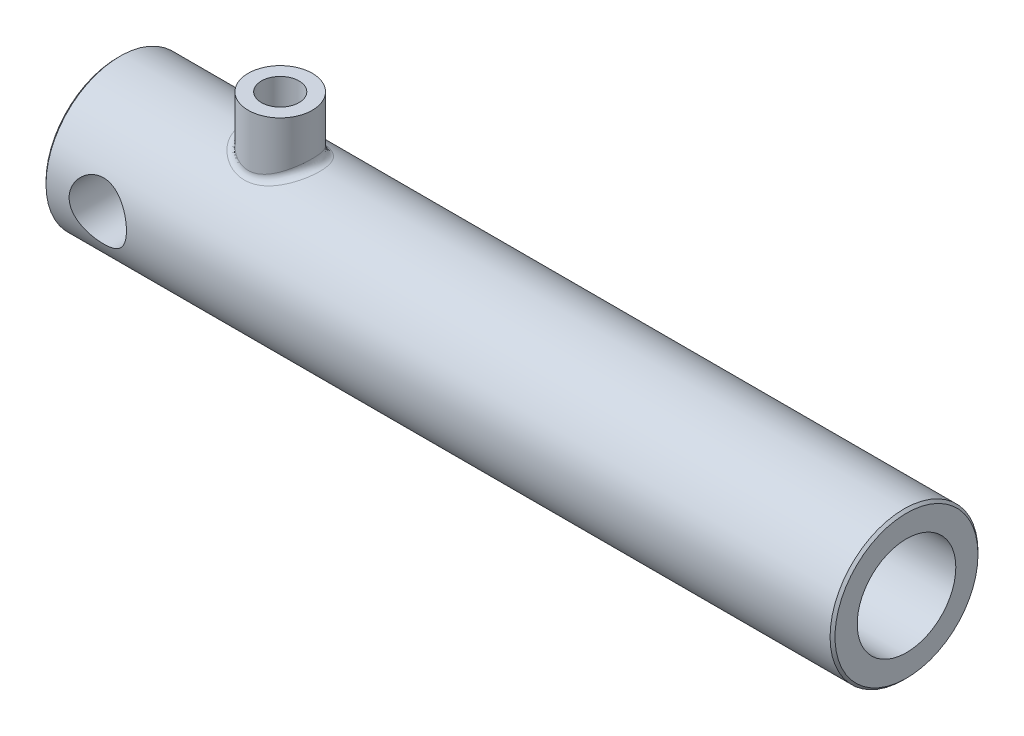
ISO-10303-21;
HEADER;
FILE_DESCRIPTION(('STEP AP214'),'2;1');
FILE_NAME('part.step','',(''),(''),'','','');
FILE_SCHEMA(('AUTOMOTIVE_DESIGN { 1 0 10303 214 1 1 1 1 }'));
ENDSEC;
DATA;
#1=APPLICATION_CONTEXT('core data for automotive mechanical design processes');
#2=APPLICATION_PROTOCOL_DEFINITION('international standard','automotive_design',2000,#1);
#3=PRODUCT_CONTEXT('',#1,'mechanical');
#4=PRODUCT('Part','Part','',(#3));
#5=PRODUCT_RELATED_PRODUCT_CATEGORY('part','',(#4));
#6=PRODUCT_DEFINITION_FORMATION('','',#4);
#7=PRODUCT_DEFINITION_CONTEXT('part definition',#1,'design');
#8=PRODUCT_DEFINITION('design','',#6,#7);
#9=PRODUCT_DEFINITION_SHAPE('','',#8);
#10=(LENGTH_UNIT() NAMED_UNIT(*) SI_UNIT(.MILLI.,.METRE.));
#11=(NAMED_UNIT(*) PLANE_ANGLE_UNIT() SI_UNIT($,.RADIAN.));
#12=(NAMED_UNIT(*) SI_UNIT($,.STERADIAN.) SOLID_ANGLE_UNIT());
#13=UNCERTAINTY_MEASURE_WITH_UNIT(LENGTH_MEASURE(1.E-05),#10,'distance_accuracy_value','');
#14=(GEOMETRIC_REPRESENTATION_CONTEXT(3) GLOBAL_UNCERTAINTY_ASSIGNED_CONTEXT((#13)) GLOBAL_UNIT_ASSIGNED_CONTEXT((#10,
#11,#12)) REPRESENTATION_CONTEXT('',''));
#15=CARTESIAN_POINT('',(0.,0.,0.));
#16=DIRECTION('',(0.,0.,1.));
#17=DIRECTION('',(1.,0.,0.));
#18=AXIS2_PLACEMENT_3D('',#15,#16,#17);
#19=CARTESIAN_POINT('',(320.,0.,0.));
#20=DIRECTION('',(-1.,0.,0.));
#21=DIRECTION('',(0.,0.,1.));
#22=AXIS2_PLACEMENT_3D('',#19,#20,#21);
#23=CYLINDRICAL_SURFACE('',#22,30.);
#24=CARTESIAN_POINT('',(60.006404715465,26.7977398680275,-13.4863315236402));
#25=CARTESIAN_POINT('',(60.7995862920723,27.5860929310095,-11.9198506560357));
#26=CARTESIAN_POINT('',(61.1301934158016,29.477483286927,-12.0534220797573));
#27=CARTESIAN_POINT('',(60.4318607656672,26.7190979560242,-13.6425965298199));
#28=CARTESIAN_POINT('',(61.1620944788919,27.518264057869,-12.0773010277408));
#29=CARTESIAN_POINT('',(61.4758771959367,29.3909772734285,-12.1930840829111));
#30=CARTESIAN_POINT('',(60.86597230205,26.6468962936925,-13.7826762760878));
#31=CARTESIAN_POINT('',(61.5352823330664,27.4552645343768,-12.2197453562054));
#32=CARTESIAN_POINT('',(61.8285935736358,29.3115555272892,-12.3182804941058));
#33=CARTESIAN_POINT('',(61.7484896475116,26.5181419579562,-14.0288089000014));
#34=CARTESIAN_POINT('',(62.296516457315,27.3425800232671,-12.4703362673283));
#35=CARTESIAN_POINT('',(62.5456404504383,29.1699259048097,-12.538261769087));
#36=CARTESIAN_POINT('',(62.1968953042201,26.4615891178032,-14.134862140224));
#37=CARTESIAN_POINT('',(62.6850140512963,27.2927441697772,-12.5788437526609));
#38=CARTESIAN_POINT('',(62.9099708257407,29.1077178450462,-12.633046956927));
#39=CARTESIAN_POINT('',(63.1038768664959,26.366543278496,-14.3113753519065));
#40=CARTESIAN_POINT('',(63.4724334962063,27.2088772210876,-12.7594716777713));
#41=CARTESIAN_POINT('',(63.6468949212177,29.0031675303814,-12.7908058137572));
#42=CARTESIAN_POINT('',(63.5624408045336,26.328030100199,-14.3818751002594));
#43=CARTESIAN_POINT('',(63.8718989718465,27.1747031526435,-12.8319118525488));
#44=CARTESIAN_POINT('',(64.0194789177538,28.9608030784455,-12.8538150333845));
#45=CARTESIAN_POINT('',(64.4860504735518,26.2706902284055,-14.4863534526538));
#46=CARTESIAN_POINT('',(64.6771217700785,27.1238391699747,-12.9391763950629));
#47=CARTESIAN_POINT('',(64.7699133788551,28.8977292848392,-12.9471926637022));
#48=CARTESIAN_POINT('',(64.9510955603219,26.2518615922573,-14.5203356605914));
#49=CARTESIAN_POINT('',(65.0835144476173,27.1070656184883,-12.9741789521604));
#50=CARTESIAN_POINT('',(65.1477633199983,28.8770178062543,-12.9775642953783));
#51=CARTESIAN_POINT('',(65.82846480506,26.235750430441,-14.5494184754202));
#52=CARTESIAN_POINT('',(65.849978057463,27.0927352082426,-13.0040890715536));
#53=CARTESIAN_POINT('',(65.8606273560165,28.8592955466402,-13.0035570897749));
#54=CARTESIAN_POINT('',(66.2405823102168,26.2362020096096,-14.5486080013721));
#55=CARTESIAN_POINT('',(66.2103665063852,27.0931384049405,-13.0032528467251));
#56=CARTESIAN_POINT('',(66.1954735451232,28.8597922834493,-13.0028327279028));
#57=CARTESIAN_POINT('',(67.0630353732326,26.2530859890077,-14.5181194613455));
#58=CARTESIAN_POINT('',(66.9287941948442,27.108153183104,-12.9719022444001));
#59=CARTESIAN_POINT('',(66.8637180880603,28.878364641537,-12.9755835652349));
#60=CARTESIAN_POINT('',(67.4733713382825,26.2695145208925,-14.4884483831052));
#61=CARTESIAN_POINT('',(67.2872981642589,27.122780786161,-12.9413544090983));
#62=CARTESIAN_POINT('',(67.1971167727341,28.896436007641,-12.9490650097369));
#63=CARTESIAN_POINT('',(68.2891582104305,26.3177519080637,-14.4006396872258));
#64=CARTESIAN_POINT('',(67.9986652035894,27.1655821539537,-12.8511885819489));
#65=CARTESIAN_POINT('',(67.8599450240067,28.9494970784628,-12.8705859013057));
#66=CARTESIAN_POINT('',(68.6946097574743,26.3495587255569,-14.3425058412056));
#67=CARTESIAN_POINT('',(68.3519687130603,27.1938079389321,-12.7914600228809));
#68=CARTESIAN_POINT('',(68.1893751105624,28.9844845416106,-12.8186287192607));
#69=CARTESIAN_POINT('',(69.4980630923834,26.4274674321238,-14.1984386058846));
#70=CARTESIAN_POINT('',(69.0501686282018,27.2626361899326,-12.6439244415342));
#71=CARTESIAN_POINT('',(68.8421823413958,29.0701840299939,-12.6898684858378));
#72=CARTESIAN_POINT('',(69.8960597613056,26.473578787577,-14.1124868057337));
#73=CARTESIAN_POINT('',(69.3954536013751,27.3033283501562,-12.5559191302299));
#74=CARTESIAN_POINT('',(69.1655553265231,29.1209064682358,-12.6130489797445));
#75=CARTESIAN_POINT('',(70.6697172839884,26.5769569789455,-13.9167955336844));
#76=CARTESIAN_POINT('',(70.0642215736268,27.3940515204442,-12.3563496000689));
#77=CARTESIAN_POINT('',(69.7941534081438,29.2346223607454,-12.4381497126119));
#78=CARTESIAN_POINT('',(71.0456889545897,26.6338393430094,-13.8078643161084));
#79=CARTESIAN_POINT('',(70.3884007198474,27.4438567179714,-12.2453606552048));
#80=CARTESIAN_POINT('',(70.0996310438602,29.297192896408,-12.340792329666));
#81=CARTESIAN_POINT('',(71.7860813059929,26.757974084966,-13.5657408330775));
#82=CARTESIAN_POINT('',(71.0241215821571,27.5518720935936,-11.9997383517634));
#83=CARTESIAN_POINT('',(70.7012011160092,29.4337409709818,-12.1243942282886));
#84=CARTESIAN_POINT('',(72.1504971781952,26.8252307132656,-13.4325386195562));
#85=CARTESIAN_POINT('',(71.3358977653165,27.6101828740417,-11.8648501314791));
#86=CARTESIAN_POINT('',(70.9972896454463,29.5077231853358,-12.0053446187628));
#87=CARTESIAN_POINT('',(72.8660045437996,26.9683134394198,-13.1429125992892));
#88=CARTESIAN_POINT('',(71.9449914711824,27.7333418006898,-11.5730252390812));
#89=CARTESIAN_POINT('',(71.5786406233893,29.6651140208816,-11.7464910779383));
#90=CARTESIAN_POINT('',(73.2170916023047,27.0441423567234,-12.9864811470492));
#91=CARTESIAN_POINT('',(72.2424751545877,27.7982864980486,-11.4158161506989));
#92=CARTESIAN_POINT('',(71.8638994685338,29.7485257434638,-11.6066803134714));
#93=CARTESIAN_POINT('',(73.9043585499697,27.2024707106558,-12.6514784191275));
#94=CARTESIAN_POINT('',(72.8214164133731,27.9327756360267,-11.0810613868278));
#95=CARTESIAN_POINT('',(72.4223050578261,29.9226867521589,-11.3072712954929));
#96=CARTESIAN_POINT('',(74.2405370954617,27.2849707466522,-12.4729051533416));
#97=CARTESIAN_POINT('',(73.1029730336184,28.0024037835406,-10.9032425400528));
#98=CARTESIAN_POINT('',(72.6954507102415,30.0134366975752,-11.1476712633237));
#99=CARTESIAN_POINT('',(74.9316537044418,27.4637858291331,-12.0744804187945));
#100=CARTESIAN_POINT('',(73.6781531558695,28.1519793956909,-10.5088779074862));
#101=CARTESIAN_POINT('',(73.2569841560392,30.2101330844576,-10.7915787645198));
#102=CARTESIAN_POINT('',(75.2847726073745,27.5606361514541,-11.8522579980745));
#103=CARTESIAN_POINT('',(73.9696359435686,28.2322504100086,-10.2900670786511));
#104=CARTESIAN_POINT('',(73.5438938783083,30.3166683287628,-10.5929672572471));
#105=CARTESIAN_POINT('',(75.9692048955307,27.7575170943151,-11.3835316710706));
#106=CARTESIAN_POINT('',(74.5297861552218,28.393516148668,-9.83229579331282));
#107=CARTESIAN_POINT('',(74.0999963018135,30.533237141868,-10.1740426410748));
#108=CARTESIAN_POINT('',(76.3005388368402,27.8575445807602,-11.1370512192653));
#109=CARTESIAN_POINT('',(74.798418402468,28.4745638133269,-9.59302855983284));
#110=CARTESIAN_POINT('',(74.3692057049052,30.6432672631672,-9.95375049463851));
#111=CARTESIAN_POINT('',(76.9405737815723,28.0584790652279,-10.6206669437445));
#112=CARTESIAN_POINT('',(75.3123394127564,28.6352444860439,-9.09631081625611));
#113=CARTESIAN_POINT('',(74.8892352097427,30.8642949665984,-9.49223153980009));
#114=CARTESIAN_POINT('',(77.2492535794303,28.1593867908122,-10.3507416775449));
#115=CARTESIAN_POINT('',(75.5574517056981,28.7148880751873,-8.83857551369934));
#116=CARTESIAN_POINT('',(75.1400380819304,30.9752933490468,-9.25098556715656));
#117=CARTESIAN_POINT('',(77.8422092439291,28.359600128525,-9.7888739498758));
#118=CARTESIAN_POINT('',(76.0232451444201,28.8706302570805,-8.30747567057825));
#119=CARTESIAN_POINT('',(75.6218155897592,31.1955277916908,-8.74881573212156));
#120=CARTESIAN_POINT('',(78.1264780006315,28.4589052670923,-9.4969251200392));
#121=CARTESIAN_POINT('',(76.2436833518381,28.9466981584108,-8.033912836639));
#122=CARTESIAN_POINT('',(75.8527844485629,31.3047633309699,-8.48788617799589));
#123=CARTESIAN_POINT('',(78.6910209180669,28.6614647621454,-8.86782338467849));
#124=CARTESIAN_POINT('',(76.6765064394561,29.0994875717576,-7.45064210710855));
#125=CARTESIAN_POINT('',(76.31147655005,31.5275785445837,-7.92562588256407));
#126=CARTESIAN_POINT('',(78.9690933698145,28.764384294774,-8.52892499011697));
#127=CARTESIAN_POINT('',(76.8862095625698,29.1756039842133,-7.13995684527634));
#128=CARTESIAN_POINT('',(76.5374109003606,31.6407899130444,-7.62273510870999));
#129=CARTESIAN_POINT('',(79.4926993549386,28.9627465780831,-7.82889763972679));
#130=CARTESIAN_POINT('',(77.2757623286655,29.3196646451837,-6.50637794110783));
#131=CARTESIAN_POINT('',(76.9628416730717,31.8589881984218,-6.99708497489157));
#132=CARTESIAN_POINT('',(79.7382343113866,29.0581896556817,-7.46776965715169));
#133=CARTESIAN_POINT('',(77.4551631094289,29.3874757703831,-6.18351791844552));
#134=CARTESIAN_POINT('',(77.1623392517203,31.9639754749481,-6.67432648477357));
#135=CARTESIAN_POINT('',(80.1945957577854,29.2389040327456,-6.72549872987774));
#136=CARTESIAN_POINT('',(77.7840066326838,29.5135019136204,-5.52862897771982));
#137=CARTESIAN_POINT('',(77.5331337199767,32.1627610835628,-6.01092111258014));
#138=CARTESIAN_POINT('',(80.4054314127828,29.3241780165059,-6.34436110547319));
#139=CARTESIAN_POINT('',(77.9329751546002,29.5715553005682,-5.19681018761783));
#140=CARTESIAN_POINT('',(77.7044380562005,32.2565623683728,-5.67027898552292));
#141=CARTESIAN_POINT('',(80.7903249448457,29.4821030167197,-5.56451420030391));
#142=CARTESIAN_POINT('',(78.2013094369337,29.6771466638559,-4.52664913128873));
#143=CARTESIAN_POINT('',(78.0171647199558,32.4302796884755,-4.97329004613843));
#144=CARTESIAN_POINT('',(80.9643853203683,29.5547548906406,-5.16580611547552));
#145=CARTESIAN_POINT('',(78.3202009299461,29.7245091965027,-4.18869750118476));
#146=CARTESIAN_POINT('',(78.1585890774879,32.5101966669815,-4.61694430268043));
#147=CARTESIAN_POINT('',(81.2660703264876,29.6820199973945,-4.37384337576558));
#148=CARTESIAN_POINT('',(78.5238158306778,29.8061421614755,-3.5254663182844));
#149=CARTESIAN_POINT('',(78.4037086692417,32.6501881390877,-3.90912682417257));
#150=CARTESIAN_POINT('',(81.3955639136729,29.7373469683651,-3.98129208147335));
#151=CARTESIAN_POINT('',(78.6095976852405,29.8408122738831,-3.20075072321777));
#152=CARTESIAN_POINT('',(78.5089224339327,32.711047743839,-3.55828371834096));
#153=CARTESIAN_POINT('',(81.6179721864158,29.8330410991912,-3.18591556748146));
#154=CARTESIAN_POINT('',(78.7556607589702,29.9000660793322,-2.54891802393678));
#155=CARTESIAN_POINT('',(78.6896295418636,32.8163111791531,-2.84741517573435));
#156=CARTESIAN_POINT('',(81.7108879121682,29.8734086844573,-2.78309064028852));
#157=CARTESIAN_POINT('',(78.8156408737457,29.9245292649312,-2.22240633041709));
#158=CARTESIAN_POINT('',(78.7651237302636,32.860715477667,-2.48739000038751));
#159=CARTESIAN_POINT('',(81.8589012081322,29.9379746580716,-1.97068919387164));
#160=CARTESIAN_POINT('',(78.9107328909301,29.9633862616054,-1.56809514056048));
#161=CARTESIAN_POINT('',(78.8853847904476,32.9317379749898,-1.76130540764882));
#162=CARTESIAN_POINT('',(81.914020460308,29.9621823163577,-1.56111668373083));
#163=CARTESIAN_POINT('',(78.9456481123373,29.9777000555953,-1.24099273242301));
#164=CARTESIAN_POINT('',(78.930169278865,32.9583663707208,-1.39524957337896));
#165=CARTESIAN_POINT('',(81.9857685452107,29.9937305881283,-0.738558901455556));
#166=CARTESIAN_POINT('',(78.9911024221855,29.9963438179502,-0.585799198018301));
#167=CARTESIAN_POINT('',(78.9884647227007,32.9930694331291,-0.660087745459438));
#168=CARTESIAN_POINT('',(82.0024002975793,30.0010724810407,-0.325573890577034));
#169=CARTESIAN_POINT('',(79.0015382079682,30.0006314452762,-0.258461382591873));
#170=CARTESIAN_POINT('',(79.0019780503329,33.0011455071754,-0.290981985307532));
#171=CARTESIAN_POINT('',(81.9972019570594,29.9987823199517,0.462709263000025));
#172=CARTESIAN_POINT('',(78.998254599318,29.9992834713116,0.367263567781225));
#173=CARTESIAN_POINT('',(78.9977543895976,32.9986263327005,0.413546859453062));
#174=CARTESIAN_POINT('',(81.9787178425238,29.990626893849,0.838034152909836));
#175=CARTESIAN_POINT('',(78.9866420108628,29.9945133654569,0.664976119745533));
#176=CARTESIAN_POINT('',(78.9827360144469,32.989655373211,0.748993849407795));
#177=CARTESIAN_POINT('',(81.9099574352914,29.9603997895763,1.58568192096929));
#178=CARTESIAN_POINT('',(78.9430624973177,29.9766406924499,1.26072694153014));
#179=CARTESIAN_POINT('',(78.926868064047,32.9564055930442,1.41720477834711));
#180=CARTESIAN_POINT('',(81.8596833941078,29.9383290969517,1.95800500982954));
#181=CARTESIAN_POINT('',(78.9111802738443,29.9635728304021,1.55820058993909));
#182=CARTESIAN_POINT('',(78.8860203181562,32.9321278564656,1.74996890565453));
#183=CARTESIAN_POINT('',(81.7279124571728,29.8808235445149,2.69698986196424));
#184=CARTESIAN_POINT('',(78.8265858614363,29.9289983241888,2.15303442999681));
#185=CARTESIAN_POINT('',(78.7789562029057,32.8688718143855,2.41043734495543));
#186=CARTESIAN_POINT('',(81.6464159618,29.8453888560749,3.06365169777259));
#187=CARTESIAN_POINT('',(78.7740295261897,29.9075550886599,2.44986879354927));
#188=CARTESIAN_POINT('',(78.7127401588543,32.8298936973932,2.73814172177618));
#189=CARTESIAN_POINT('',(81.4530715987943,29.7620208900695,3.78884444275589));
#190=CARTESIAN_POINT('',(78.6474694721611,29.856152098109,3.04264810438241));
#191=CARTESIAN_POINT('',(78.5556475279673,32.7381890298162,3.38628345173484));
#192=CARTESIAN_POINT('',(81.3412229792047,29.7140873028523,4.14737515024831));
#193=CARTESIAN_POINT('',(78.5736836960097,29.8262797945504,3.33812839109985));
#194=CARTESIAN_POINT('',(78.4647703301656,32.6854621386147,3.70672062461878));
#195=CARTESIAN_POINT('',(81.0889175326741,29.6071256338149,4.85227477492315));
#196=CARTESIAN_POINT('',(78.4044607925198,29.7582262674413,3.92554195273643));
#197=CARTESIAN_POINT('',(78.2597717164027,32.5678044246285,4.33672535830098));
#198=CARTESIAN_POINT('',(80.948606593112,29.5481542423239,5.19869555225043));
#199=CARTESIAN_POINT('',(78.3094009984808,29.7201920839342,4.21709540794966));
#200=CARTESIAN_POINT('',(78.1457688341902,32.502935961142,4.64633926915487));
#201=CARTESIAN_POINT('',(80.6402365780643,29.4202762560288,5.87940015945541));
#202=CARTESIAN_POINT('',(78.0968928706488,29.6359492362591,4.79669566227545));
#203=CARTESIAN_POINT('',(77.8952176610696,32.3622703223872,5.25471968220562));
#204=CARTESIAN_POINT('',(80.4721677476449,29.3513661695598,6.21367967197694));
#205=CARTESIAN_POINT('',(77.9797315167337,29.5898489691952,5.08445431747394));
#206=CARTESIAN_POINT('',(77.7586614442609,32.2864693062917,5.55348232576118));
#207=CARTESIAN_POINT('',(80.1096712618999,29.2051366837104,6.86821520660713));
#208=CARTESIAN_POINT('',(77.7227302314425,29.4899567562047,5.65451008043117));
#209=CARTESIAN_POINT('',(77.464132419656,32.1256170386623,6.13847410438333));
#210=CARTESIAN_POINT('',(79.9152486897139,29.1278189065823,7.18847391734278));
#211=CARTESIAN_POINT('',(77.5832029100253,29.4362761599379,5.93661808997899));
#212=CARTESIAN_POINT('',(77.3061637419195,32.0405675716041,6.42470564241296));
#213=CARTESIAN_POINT('',(79.5013729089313,28.9663974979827,7.81359328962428));
#214=CARTESIAN_POINT('',(77.2814153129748,29.3219987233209,6.49339598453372));
#215=CARTESIAN_POINT('',(76.9698889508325,31.8630042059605,6.98340669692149));
#216=CARTESIAN_POINT('',(79.2819106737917,28.8822914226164,8.11844834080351));
#217=CARTESIAN_POINT('',(77.1194472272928,29.261497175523,6.76797478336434));
#218=CARTESIAN_POINT('',(76.7915755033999,31.7704876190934,7.25587119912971));
#219=CARTESIAN_POINT('',(78.5497775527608,28.6080506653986,9.05678838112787));
#220=CARTESIAN_POINT('',(76.5739779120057,29.0616427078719,7.61724881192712));
#221=CARTESIAN_POINT('',(76.1967160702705,31.4688230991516,8.09451353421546));
#222=CARTESIAN_POINT('',(77.9931356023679,28.4084434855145,9.65979496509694));
#223=CARTESIAN_POINT('',(76.1473625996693,28.9105907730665,8.17981074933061));
#224=CARTESIAN_POINT('',(75.7444435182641,31.2492554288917,8.63345126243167));
#225=CARTESIAN_POINT('',(76.7809613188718,28.0040194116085,10.7763013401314));
#226=CARTESIAN_POINT('',(75.1911588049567,28.5943684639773,9.23856299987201));
#227=CARTESIAN_POINT('',(74.7595498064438,30.8043894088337,9.63132993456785));
#228=CARTESIAN_POINT('',(76.1253195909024,27.7991969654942,11.2897007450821));
#229=CARTESIAN_POINT('',(74.6632661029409,28.4293682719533,9.73641026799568));
#230=CARTESIAN_POINT('',(74.2268397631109,30.5790849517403,10.0901811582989));
#231=CARTESIAN_POINT('',(75.051971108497,27.4962318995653,12.0012710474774));
#232=CARTESIAN_POINT('',(73.7780669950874,28.1791073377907,10.4362646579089));
#233=CARTESIAN_POINT('',(73.3547422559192,30.2458237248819,10.7261478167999));
#234=CARTESIAN_POINT('',(74.6644651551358,27.3925626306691,12.2354158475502));
#235=CARTESIAN_POINT('',(73.4569400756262,28.0927380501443,10.6675809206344));
#236=CARTESIAN_POINT('',(73.0398929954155,30.1317876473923,10.9354149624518));
#237=CARTESIAN_POINT('',(73.8667804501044,27.1929143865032,12.6729301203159));
#238=CARTESIAN_POINT('',(72.7906257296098,27.92493993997,11.1018569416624));
#239=CARTESIAN_POINT('',(72.3917727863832,29.9121748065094,11.3264437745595));
#240=CARTESIAN_POINT('',(73.456611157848,27.0969322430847,12.8763123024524));
#241=CARTESIAN_POINT('',(72.445361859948,27.843386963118,11.3052865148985));
#242=CARTESIAN_POINT('',(72.0585095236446,29.8065945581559,11.508216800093));
#243=CARTESIAN_POINT('',(72.6167985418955,26.9161020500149,13.2501517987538));
#244=CARTESIAN_POINT('',(71.7339940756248,27.6887115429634,11.6804887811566));
#245=CARTESIAN_POINT('',(71.376160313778,29.6076815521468,11.8423362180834));
#246=CARTESIAN_POINT('',(72.1871990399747,26.8312304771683,13.4206790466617));
#247=CARTESIAN_POINT('',(71.367709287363,27.6154188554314,11.8527876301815));
#248=CARTESIAN_POINT('',(71.0271099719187,29.5143229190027,11.9947451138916));
#249=CARTESIAN_POINT('',(71.3106788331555,26.6755755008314,13.7274647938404));
#250=CARTESIAN_POINT('',(70.616900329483,27.4803854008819,12.16341925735));
#251=CARTESIAN_POINT('',(70.3149357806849,29.3431026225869,12.2689351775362));
#252=CARTESIAN_POINT('',(70.8637686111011,26.6047837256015,13.863743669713));
#253=CARTESIAN_POINT('',(70.2320135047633,27.4184717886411,12.3022032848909));
#254=CARTESIAN_POINT('',(69.9518204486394,29.2652317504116,12.3907345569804));
#255=CARTESIAN_POINT('',(70.0211793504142,26.4890874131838,14.083371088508));
#256=CARTESIAN_POINT('',(69.5038061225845,27.3169748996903,12.5261730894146));
#257=CARTESIAN_POINT('',(69.2672152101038,29.1379659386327,12.5870267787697));
#258=CARTESIAN_POINT('',(69.6273810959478,26.4419236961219,14.1715141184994));
#259=CARTESIAN_POINT('',(69.1623618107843,27.2753856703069,12.6163780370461));
#260=CARTESIAN_POINT('',(68.9472534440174,29.0860859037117,12.6658046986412));
#261=CARTESIAN_POINT('',(68.8318037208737,26.3614963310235,14.3205695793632));
#262=CARTESIAN_POINT('',(68.4713435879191,27.2043764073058,12.7689624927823));
#263=CARTESIAN_POINT('',(68.3008454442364,28.9976158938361,12.7990231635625));
#264=CARTESIAN_POINT('',(68.4300233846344,26.3282348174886,14.3814778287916));
#265=CARTESIAN_POINT('',(68.1213885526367,27.174876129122,12.8315197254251));
#266=CARTESIAN_POINT('',(67.9743982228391,28.9610282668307,12.8534599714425));
#267=CARTESIAN_POINT('',(67.623808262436,26.2769202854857,14.4750232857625));
#268=CARTESIAN_POINT('',(67.4185872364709,27.1293621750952,12.9275535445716));
#269=CARTESIAN_POINT('',(67.3193470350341,28.9045823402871,12.9370663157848));
#270=CARTESIAN_POINT('',(67.219404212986,26.2587765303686,14.5078291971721));
#271=CARTESIAN_POINT('',(67.0653561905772,27.1132128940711,12.9613213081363));
#272=CARTESIAN_POINT('',(66.9907680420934,28.8846242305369,12.9663866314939));
#273=CARTESIAN_POINT('',(66.4083990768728,26.2379924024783,14.5453849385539));
#274=CARTESIAN_POINT('',(66.357021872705,27.0947334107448,12.9999338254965));
#275=CARTESIAN_POINT('',(66.3318249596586,28.8617617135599,12.9999521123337));
#276=CARTESIAN_POINT('',(66.0017973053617,26.2353571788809,14.5501254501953));
#277=CARTESIAN_POINT('',(66.0014736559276,27.0923845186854,13.0048176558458));
#278=CARTESIAN_POINT('',(66.0014603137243,28.8588629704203,13.004188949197));
#279=CARTESIAN_POINT('',(65.1891398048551,26.2457046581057,14.5314520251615));
#280=CARTESIAN_POINT('',(65.2914999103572,27.1015878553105,12.9856145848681));
#281=CARTESIAN_POINT('',(65.3411746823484,28.8702451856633,12.9874995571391));
#282=CARTESIAN_POINT('',(64.7830852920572,26.2587058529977,14.5080047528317));
#283=CARTESIAN_POINT('',(64.9366268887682,27.1131682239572,12.9614690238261));
#284=CARTESIAN_POINT('',(65.0112546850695,28.8845464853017,12.966543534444));
#285=CARTESIAN_POINT('',(63.9750834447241,26.2998938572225,14.4332045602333));
#286=CARTESIAN_POINT('',(64.2316877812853,27.1497384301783,12.8846298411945));
#287=CARTESIAN_POINT('',(64.3547517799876,28.9298532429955,12.8996907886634));
#288=CARTESIAN_POINT('',(63.5731358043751,26.3280795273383,14.3818537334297));
#289=CARTESIAN_POINT('',(63.8811903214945,27.1747725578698,12.831842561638));
#290=CARTESIAN_POINT('',(64.0281686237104,28.9608574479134,12.8537959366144));
#291=CARTESIAN_POINT('',(62.7774248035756,26.3985543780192,14.2520785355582));
#292=CARTESIAN_POINT('',(63.1890822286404,27.237105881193,12.6988475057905));
#293=CARTESIAN_POINT('',(63.3816520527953,29.0383797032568,12.7378092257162));
#294=CARTESIAN_POINT('',(62.3836396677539,26.4407988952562,14.1737398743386));
#295=CARTESIAN_POINT('',(62.8470551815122,27.2744392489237,12.6185671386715));
#296=CARTESIAN_POINT('',(63.0617009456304,29.0848486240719,12.6677939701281));
#297=CARTESIAN_POINT('',(61.6054791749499,26.5380414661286,13.9908207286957));
#298=CARTESIAN_POINT('',(62.1733986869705,27.3599363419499,12.4318025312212));
#299=CARTESIAN_POINT('',(62.429444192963,29.1918153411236,12.5043098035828));
#300=CARTESIAN_POINT('',(61.2211040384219,26.5930398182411,13.8862396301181));
#301=CARTESIAN_POINT('',(61.841436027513,27.4081921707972,12.325106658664));
#302=CARTESIAN_POINT('',(62.1171387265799,29.2523134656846,12.4108403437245));
#303=CARTESIAN_POINT('',(60.4640052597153,26.7141120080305,13.6518714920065));
#304=CARTESIAN_POINT('',(61.1902442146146,27.5137730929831,12.0870276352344));
#305=CARTESIAN_POINT('',(61.5019946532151,29.3854927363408,12.201373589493));
#306=CARTESIAN_POINT('',(60.0912805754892,26.7801848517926,13.5220867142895));
#307=CARTESIAN_POINT('',(60.8707462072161,27.5711984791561,11.9553967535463));
#308=CARTESIAN_POINT('',(61.1991551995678,29.458172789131,12.0853783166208));
#309=CARTESIAN_POINT('',(59.3591794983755,26.9215744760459,13.2383513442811));
#310=CARTESIAN_POINT('',(60.2462648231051,27.6932110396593,11.6690504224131));
#311=CARTESIAN_POINT('',(60.6043218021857,29.6137012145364,11.8317895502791));
#312=CARTESIAN_POINT('',(58.9998084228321,26.9968948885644,13.0843912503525));
#313=CARTESIAN_POINT('',(59.9410926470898,27.7579011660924,11.5140518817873));
#314=CARTESIAN_POINT('',(60.3123321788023,29.6965535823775,11.694187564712));
#315=CARTESIAN_POINT('',(58.278284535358,27.1588107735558,12.7450421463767));
#316=CARTESIAN_POINT('',(59.3318018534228,27.8958567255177,11.1742818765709));
#317=CARTESIAN_POINT('',(59.7260927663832,29.8746608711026,11.3908939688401));
#318=CARTESIAN_POINT('',(57.9169170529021,27.2457845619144,12.5584542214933));
#319=CARTESIAN_POINT('',(59.0285024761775,27.9694669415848,10.9881406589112));
#320=CARTESIAN_POINT('',(59.4324810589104,29.970331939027,11.2241308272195));
#321=CARTESIAN_POINT('',(57.212436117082,27.4254459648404,12.1611038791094));
#322=CARTESIAN_POINT('',(58.441379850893,28.1200318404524,10.5944388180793));
#323=CARTESIAN_POINT('',(58.860089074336,30.1679592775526,10.8689985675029));
#324=CARTESIAN_POINT('',(56.8693240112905,27.5181340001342,11.9503396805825));
#325=CARTESIAN_POINT('',(58.1575098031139,28.1970692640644,10.3865543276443));
#326=CARTESIAN_POINT('',(58.5813098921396,30.2699160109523,10.6806278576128));
#327=CARTESIAN_POINT('',(56.2026772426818,27.7069661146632,11.5057537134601));
#328=CARTESIAN_POINT('',(57.6104044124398,28.3522816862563,9.95140202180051));
#329=CARTESIAN_POINT('',(58.0396582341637,30.477631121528,10.2832787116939));
#330=CARTESIAN_POINT('',(55.879150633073,27.8031115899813,11.2719225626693));
#331=CARTESIAN_POINT('',(57.3472177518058,28.430509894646,9.7238297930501));
#332=CARTESIAN_POINT('',(57.7767923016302,30.5833910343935,10.0742918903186));
#333=CARTESIAN_POINT('',(55.2531767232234,27.9965812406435,10.7824257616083));
#334=CARTESIAN_POINT('',(56.842623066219,28.5859835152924,9.25151023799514));
#335=CARTESIAN_POINT('',(57.2681874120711,30.7962074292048,9.63680364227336));
#336=CARTESIAN_POINT('',(54.9507309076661,28.0939054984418,10.5267585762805));
#337=CARTESIAN_POINT('',(56.6013380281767,28.6632473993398,9.00650838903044));
#338=CARTESIAN_POINT('',(57.0224496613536,30.9032640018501,9.40830084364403));
#339=CARTESIAN_POINT('',(54.3366100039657,28.2980766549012,9.96580809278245));
#340=CARTESIAN_POINT('',(56.1161129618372,28.8232095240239,8.47375732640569));
#341=CARTESIAN_POINT('',(56.5234753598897,31.1278520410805,8.90695079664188));
#342=CARTESIAN_POINT('',(54.0275040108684,28.404808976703,9.65815227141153));
#343=CARTESIAN_POINT('',(55.8752809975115,28.9054657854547,8.1843301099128));
#344=CARTESIAN_POINT('',(56.2723262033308,31.2452574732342,8.63198310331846));
#345=CARTESIAN_POINT('',(53.4388743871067,28.6141243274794,9.01913995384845));
#346=CARTESIAN_POINT('',(55.4223151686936,29.0641107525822,7.59016688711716));
#347=CARTESIAN_POINT('',(55.7940636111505,31.4755041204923,8.06086521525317));
#348=CARTESIAN_POINT('',(53.1593413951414,28.7167086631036,8.68779101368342));
#349=CARTESIAN_POINT('',(55.2105297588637,29.1404242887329,7.28529468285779));
#350=CARTESIAN_POINT('',(55.566942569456,31.5883467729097,7.764721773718));
#351=CARTESIAN_POINT('',(52.6315805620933,28.9150623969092,8.0028939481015));
#352=CARTESIAN_POINT('',(54.8159570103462,29.285375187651,6.66297756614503));
#353=CARTESIAN_POINT('',(55.1381359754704,31.8065356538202,7.1525943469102));
#354=CARTESIAN_POINT('',(52.3833677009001,29.0108285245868,7.64933532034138));
#355=CARTESIAN_POINT('',(54.6336112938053,29.3538857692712,6.3455346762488));
#356=CARTESIAN_POINT('',(54.9364625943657,31.9118782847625,6.83660097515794));
#357=CARTESIAN_POINT('',(51.9205673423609,29.1928311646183,6.92234951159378));
#358=CARTESIAN_POINT('',(54.2982644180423,29.4817128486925,5.7012740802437));
#359=CARTESIAN_POINT('',(54.5604364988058,32.1120809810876,6.18685669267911));
#360=CARTESIAN_POINT('',(51.7059637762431,29.279072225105,6.54893194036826));
#361=CARTESIAN_POINT('',(54.1457117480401,29.5408791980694,5.37463104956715));
#362=CARTESIAN_POINT('',(54.3860707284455,32.206946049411,5.85311437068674));
#363=CARTESIAN_POINT('',(51.3146424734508,29.4386954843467,5.78896808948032));
#364=CARTESIAN_POINT('',(53.8712650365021,29.6484240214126,4.71845308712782));
#365=CARTESIAN_POINT('',(54.0681214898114,32.3825314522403,5.17389593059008));
#366=CARTESIAN_POINT('',(51.137505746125,29.5122180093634,5.40262994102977));
#367=CARTESIAN_POINT('',(53.7494636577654,29.6967636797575,4.38929536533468));
#368=CARTESIAN_POINT('',(53.9241975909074,32.4634061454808,4.82860582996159));
#369=CARTESIAN_POINT('',(50.8198619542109,29.6455335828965,4.61537517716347));
#370=CARTESIAN_POINT('',(53.5336493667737,29.7830048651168,3.72649764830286));
#371=CARTESIAN_POINT('',(53.6661114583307,32.6100531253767,4.12499610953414));
#372=CARTESIAN_POINT('',(50.6793550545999,29.7053265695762,4.21445849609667));
#373=CARTESIAN_POINT('',(53.4400492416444,29.8207471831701,3.39335108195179));
#374=CARTESIAN_POINT('',(53.5519493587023,32.6758253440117,3.7666764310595));
#375=CARTESIAN_POINT('',(50.4367749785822,29.8093612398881,3.40144165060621));
#376=CARTESIAN_POINT('',(53.2799660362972,29.8855695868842,2.72450145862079));
#377=CARTESIAN_POINT('',(53.3548526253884,32.7902633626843,3.04004182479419));
#378=CARTESIAN_POINT('',(50.3346750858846,29.8536137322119,2.9893494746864));
#379=CARTESIAN_POINT('',(53.2138066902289,29.9125205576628,2.38943219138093));
#380=CARTESIAN_POINT('',(53.2718962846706,32.8389410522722,2.67173403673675));
#381=CARTESIAN_POINT('',(50.1701508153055,29.9252508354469,2.15723687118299));
#382=CARTESIAN_POINT('',(53.107779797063,29.9558063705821,1.71761833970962));
#383=CARTESIAN_POINT('',(53.1382200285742,32.9177417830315,1.92803257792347));
#384=CARTESIAN_POINT('',(50.1077223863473,29.9526371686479,1.73721725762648));
#385=CARTESIAN_POINT('',(53.0681555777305,29.9720424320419,1.38161608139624));
#386=CARTESIAN_POINT('',(53.0874968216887,32.9478667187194,1.55263963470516));
#387=CARTESIAN_POINT('',(50.0274105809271,29.9879263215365,0.933070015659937));
#388=CARTESIAN_POINT('',(53.0172201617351,29.9929278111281,0.740479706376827));
#389=CARTESIAN_POINT('',(53.0222433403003,32.9866847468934,0.833932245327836));
#390=CARTESIAN_POINT('',(50.0058682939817,29.9974287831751,0.549310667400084));
#391=CARTESIAN_POINT('',(53.0036800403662,29.9984890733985,0.435999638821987));
#392=CARTESIAN_POINT('',(53.0047401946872,32.9971374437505,0.490946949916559));
#393=CARTESIAN_POINT('',(49.9962677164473,30.0016599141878,-0.21862124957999));
#394=CARTESIAN_POINT('',(52.9976231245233,30.0009758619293,-0.173596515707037));
#395=CARTESIAN_POINT('',(52.9969397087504,33.0017916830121,-0.195392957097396));
#396=CARTESIAN_POINT('',(50.0082070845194,29.9963896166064,-0.602793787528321));
#397=CARTESIAN_POINT('',(53.0051171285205,29.9978969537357,-0.478093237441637));
#398=CARTESIAN_POINT('',(53.0066404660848,32.9959943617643,-0.538747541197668));
#399=CARTESIAN_POINT('',(50.0654184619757,29.9712170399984,-1.36853872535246));
#400=CARTESIAN_POINT('',(53.0413187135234,29.9830441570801,-1.08747144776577));
#401=CARTESIAN_POINT('',(53.0531248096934,32.9683045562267,-1.22313283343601));
#402=CARTESIAN_POINT('',(50.1106860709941,29.9513166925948,-1.75011146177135));
#403=CARTESIAN_POINT('',(53.0699508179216,29.9713012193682,-1.39174357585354));
#404=CARTESIAN_POINT('',(53.0899048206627,32.9464141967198,-1.5641638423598));
#405=CARTESIAN_POINT('',(50.234010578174,29.8974083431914,-2.50783541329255));
#406=CARTESIAN_POINT('',(53.1488991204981,29.9390083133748,-2.00030279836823));
#407=CARTESIAN_POINT('',(53.1901061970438,32.8871150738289,-2.24138037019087));
#408=CARTESIAN_POINT('',(50.3120675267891,29.8634003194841,-2.88398662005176));
#409=CARTESIAN_POINT('',(53.1990621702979,29.9185207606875,-2.30401811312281));
#410=CARTESIAN_POINT('',(53.2535276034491,32.8497062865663,-2.57756588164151));
#411=CARTESIAN_POINT('',(50.4966094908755,29.7836531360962,-3.61441335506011));
#412=CARTESIAN_POINT('',(53.3194627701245,29.8695611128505,-2.89952623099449));
#413=CARTESIAN_POINT('',(53.4034682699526,32.7619844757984,-3.23038549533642));
#414=CARTESIAN_POINT('',(50.6019384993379,29.7383934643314,-3.96898379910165));
#415=CARTESIAN_POINT('',(53.3886754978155,29.8414984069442,-3.19082471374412));
#416=CARTESIAN_POINT('',(53.4890482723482,32.7121988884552,-3.54728317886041));
#417=CARTESIAN_POINT('',(50.8411987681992,29.636630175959,-4.66852554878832));
#418=CARTESIAN_POINT('',(53.5484362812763,29.7771220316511,-3.77171878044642));
#419=CARTESIAN_POINT('',(53.6834476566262,32.6002593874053,-4.17249930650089));
#420=CARTESIAN_POINT('',(50.9751399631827,29.5801226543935,-5.01349347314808));
#421=CARTESIAN_POINT('',(53.6387429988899,29.7409034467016,-4.06093237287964));
#422=CARTESIAN_POINT('',(53.792275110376,32.5381011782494,-4.48081472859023));
#423=CARTESIAN_POINT('',(51.2703754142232,29.4571498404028,-5.69166679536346));
#424=CARTESIAN_POINT('',(53.8411717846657,29.6604158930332,-4.6360546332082));
#425=CARTESIAN_POINT('',(54.0321544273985,32.4028312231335,-5.08693280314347));
#426=CARTESIAN_POINT('',(51.4316631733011,29.3906869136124,-6.02487496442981));
#427=CARTESIAN_POINT('',(53.9530065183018,29.6162561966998,-4.92166772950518));
#428=CARTESIAN_POINT('',(54.1632010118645,32.3297220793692,-5.38473793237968));
#429=CARTESIAN_POINT('',(51.7803927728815,29.2491980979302,-6.67803359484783));
#430=CARTESIAN_POINT('',(54.1988908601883,29.5202793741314,-5.4880378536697));
#431=CARTESIAN_POINT('',(54.4465444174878,32.1740845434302,-5.96849910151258));
#432=CARTESIAN_POINT('',(51.9678447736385,29.1741688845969,-6.99797884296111));
#433=CARTESIAN_POINT('',(54.3326517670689,29.4685665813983,-5.76859169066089));
#434=CARTESIAN_POINT('',(54.5988494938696,32.0915524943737,-6.25445048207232));
#435=CARTESIAN_POINT('',(52.3803208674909,29.0121068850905,-7.6429820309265));
#436=CARTESIAN_POINT('',(54.6316617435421,29.3546727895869,-6.34036340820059));
#437=CARTESIAN_POINT('',(54.9339870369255,31.9132844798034,-6.83092271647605));
#438=CARTESIAN_POINT('',(52.6069805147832,28.9246134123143,-7.96705999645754));
#439=CARTESIAN_POINT('',(54.7981263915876,29.2921129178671,-6.63117312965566));
#440=CARTESIAN_POINT('',(55.1181483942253,31.8170417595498,-7.12056771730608));
#441=CARTESIAN_POINT('',(53.0868642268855,28.7436993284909,-8.5969282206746));
#442=CARTESIAN_POINT('',(55.1562311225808,29.1602201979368,-7.20263096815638));
#443=CARTESIAN_POINT('',(55.5080547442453,31.6180364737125,-7.68351306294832));
#444=CARTESIAN_POINT('',(53.3400974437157,28.6502766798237,-8.90271212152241));
#445=CARTESIAN_POINT('',(55.3475501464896,29.0909808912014,-7.48326434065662));
#446=CARTESIAN_POINT('',(55.7138071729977,31.5152716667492,-7.95680772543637));
#447=CARTESIAN_POINT('',(53.871649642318,28.4596001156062,-9.49462389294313));
#448=CARTESIAN_POINT('',(55.7549507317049,28.9471949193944,-8.03186781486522));
#449=CARTESIAN_POINT('',(56.1456942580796,31.3055276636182,-8.48582945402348));
#450=CARTESIAN_POINT('',(54.1499784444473,28.3623447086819,-9.78074399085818));
#451=CARTESIAN_POINT('',(55.9707580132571,28.8727108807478,-8.29992670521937));
#452=CARTESIAN_POINT('',(56.371836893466,31.1985468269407,-8.74154957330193));
#453=CARTESIAN_POINT('',(54.7301813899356,28.1662290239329,-10.3319473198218));
#454=CARTESIAN_POINT('',(56.4263594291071,28.7202298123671,-8.82078717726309));
#455=CARTESIAN_POINT('',(56.8432527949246,30.982819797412,-9.23418809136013));
#456=CARTESIAN_POINT('',(55.0320570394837,28.067368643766,-10.5970292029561));
#457=CARTESIAN_POINT('',(56.6659332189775,28.6422607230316,-9.07376984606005));
#458=CARTESIAN_POINT('',(57.088527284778,30.8740734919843,-9.47110528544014));
#459=CARTESIAN_POINT('',(55.6860737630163,27.8614560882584,-11.1277760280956));
#460=CARTESIAN_POINT('',(57.190460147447,28.4778246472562,-9.58377435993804));
#461=CARTESIAN_POINT('',(57.6199170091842,30.6475699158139,-9.94546078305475));
#462=CARTESIAN_POINT('',(56.0402940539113,27.7544661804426,-11.3913523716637));
#463=CARTESIAN_POINT('',(57.4776302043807,28.3911306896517,-9.83967675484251));
#464=CARTESIAN_POINT('',(57.9077216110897,30.5298811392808,-10.1810323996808));
#465=CARTESIAN_POINT('',(56.7730390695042,27.5443554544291,-11.8904071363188));
#466=CARTESIAN_POINT('',(58.0776723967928,28.2189020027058,-10.3272960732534));
#467=CARTESIAN_POINT('',(58.5030782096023,30.2987595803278,-10.6270630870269));
#468=CARTESIAN_POINT('',(57.1515557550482,27.4412333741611,-12.125894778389));
#469=CARTESIAN_POINT('',(58.390466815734,28.1333009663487,-10.5594177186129));
#470=CARTESIAN_POINT('',(58.810623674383,30.1853254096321,-10.8375303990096));
#471=CARTESIAN_POINT('',(57.9312629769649,27.2418798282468,-12.5673660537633));
#472=CARTESIAN_POINT('',(59.0400803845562,27.9662993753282,-10.9967264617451));
#473=CARTESIAN_POINT('',(59.4441371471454,29.9660367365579,-11.2320957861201));
#474=CARTESIAN_POINT('',(58.3324649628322,27.1456518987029,-12.7733345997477));
#475=CARTESIAN_POINT('',(59.3769763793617,27.8847890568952,-11.2023392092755));
#476=CARTESIAN_POINT('',(59.7701144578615,29.8601861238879,-11.4161803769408));
#477=CARTESIAN_POINT('',(59.1549706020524,26.9633383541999,-13.1538166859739));
#478=CARTESIAN_POINT('',(60.0721248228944,27.7292834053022,-11.5835308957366));
#479=CARTESIAN_POINT('',(60.4384017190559,29.6596414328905,-11.7562366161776));
#480=CARTESIAN_POINT('',(59.5762640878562,26.8772476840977,-13.3283459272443));
#481=CARTESIAN_POINT('',(60.4305655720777,27.655140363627,-11.7595716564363));
#482=CARTESIAN_POINT('',(60.7807034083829,29.5649417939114,-11.9122222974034));
#483=CARTESIAN_POINT('',(60.006404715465,26.7977398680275,-13.4863315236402));
#484=CARTESIAN_POINT('',(60.7995862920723,27.5860929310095,-11.9198506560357));
#485=CARTESIAN_POINT('',(61.1301934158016,29.477483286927,-12.0534220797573));
#486=(BOUNDED_SURFACE() B_SPLINE_SURFACE(3,2,((#24,#25,#26),(#27,#28,#29),(#30,#31,#32),(#33,
#34,#35),(#36,#37,#38),(#39,#40,#41),(#42,#43,#44),(#45,#46,#47),(#48,#49,#50),(#51,#52,#53),
(#54,#55,#56),(#57,#58,#59),(#60,#61,#62),(#63,#64,#65),(#66,#67,#68),(#69,#70,#71),(#72,#73,
#74),(#75,#76,#77),(#78,#79,#80),(#81,#82,#83),(#84,#85,#86),(#87,#88,#89),(#90,#91,#92),(#93,
#94,#95),(#96,#97,#98),(#99,#100,#101),(#102,#103,#104),(#105,#106,#107),(#108,#109,#110),(#111,
#112,#113),(#114,#115,#116),(#117,#118,#119),(#120,#121,#122),(#123,#124,#125),(#126,#127,#128),
(#129,#130,#131),(#132,#133,#134),(#135,#136,#137),(#138,#139,#140),(#141,#142,#143),(#144,#145,
#146),(#147,#148,#149),(#150,#151,#152),(#153,#154,#155),(#156,#157,#158),(#159,#160,#161),
(#162,#163,#164),(#165,#166,#167),(#168,#169,#170),(#171,#172,#173),(#174,#175,#176),(#177,#178,
#179),(#180,#181,#182),(#183,#184,#185),(#186,#187,#188),(#189,#190,#191),(#192,#193,#194),
(#195,#196,#197),(#198,#199,#200),(#201,#202,#203),(#204,#205,#206),(#207,#208,#209),(#210,#211,
#212),(#213,#214,#215),(#216,#217,#218),(#219,#220,#221),(#222,#223,#224),(#225,#226,#227),
(#228,#229,#230),(#231,#232,#233),(#234,#235,#236),(#237,#238,#239),(#240,#241,#242),(#243,#244,
#245),(#246,#247,#248),(#249,#250,#251),(#252,#253,#254),(#255,#256,#257),(#258,#259,#260),
(#261,#262,#263),(#264,#265,#266),(#267,#268,#269),(#270,#271,#272),(#273,#274,#275),(#276,#277,
#278),(#279,#280,#281),(#282,#283,#284),(#285,#286,#287),(#288,#289,#290),(#291,#292,#293),
(#294,#295,#296),(#297,#298,#299),(#300,#301,#302),(#303,#304,#305),(#306,#307,#308),(#309,#310,
#311),(#312,#313,#314),(#315,#316,#317),(#318,#319,#320),(#321,#322,#323),(#324,#325,#326),
(#327,#328,#329),(#330,#331,#332),(#333,#334,#335),(#336,#337,#338),(#339,#340,#341),(#342,#343,
#344),(#345,#346,#347),(#348,#349,#350),(#351,#352,#353),(#354,#355,#356),(#357,#358,#359),
(#360,#361,#362),(#363,#364,#365),(#366,#367,#368),(#369,#370,#371),(#372,#373,#374),(#375,#376,
#377),(#378,#379,#380),(#381,#382,#383),(#384,#385,#386),(#387,#388,#389),(#390,#391,#392),
(#393,#394,#395),(#396,#397,#398),(#399,#400,#401),(#402,#403,#404),(#405,#406,#407),(#408,#409,
#410),(#411,#412,#413),(#414,#415,#416),(#417,#418,#419),(#420,#421,#422),(#423,#424,#425),
(#426,#427,#428),(#429,#430,#431),(#432,#433,#434),(#435,#436,#437),(#438,#439,#440),(#441,#442,
#443),(#444,#445,#446),(#447,#448,#449),(#450,#451,#452),(#453,#454,#455),(#456,#457,#458),
(#459,#460,#461),(#462,#463,#464),(#465,#466,#467),(#468,#469,#470),(#471,#472,#473),(#474,#475,
#476),(#477,#478,#479),(#480,#481,#482),(#483,#484,#485)),.UNSPECIFIED.,.T.,.F.,
.F.) B_SPLINE_SURFACE_WITH_KNOTS((4,2,2,2,2,2,2,2,2,2,2,2,2,2,2,2,2,2,2,2,2,2,2,2,2,2,2,2,2,2,2,
2,2,2,2,2,2,2,2,2,2,2,2,2,2,2,2,2,2,2,2,2,2,2,2,2,2,2,2,2,2,2,2,2,2,2,2,2,2,2,2,2,2,2,2,2,4),(3,
3),(0.,1.40037435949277,2.80073379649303,4.19952303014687,5.59817420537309,6.83295912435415,
8.06744515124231,9.30176763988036,10.5369087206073,11.7342600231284,12.9321031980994,
14.1303414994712,15.3286875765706,16.65474880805,17.9795402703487,19.305556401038,
20.6319574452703,22.0661425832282,23.5002649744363,24.9340079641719,26.367653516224,
27.730486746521,29.0932812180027,30.4552932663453,31.8172019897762,33.0558042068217,
34.2943187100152,35.532817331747,36.7713466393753,38.0036812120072,39.236449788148,
40.4689809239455,41.7019577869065,44.3699798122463,47.0409718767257,48.4766311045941,
49.9116955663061,51.3436708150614,52.774792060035,53.9999992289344,55.2253944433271,
56.4433807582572,57.661771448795,58.8816044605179,60.101345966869,61.3172489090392,
62.5331803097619,63.7490026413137,64.9653040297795,66.2433659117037,67.521522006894,
68.800200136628,70.0789682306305,71.4967092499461,72.914000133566,74.3319663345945,
75.7492525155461,77.1497361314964,78.5502260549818,79.9497399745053,81.3491109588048,
82.6159462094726,83.8826928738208,85.1492723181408,86.4158537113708,87.6356712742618,
88.8559130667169,90.0758653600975,91.2962927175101,92.5947146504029,93.8935852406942,
95.192966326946,96.4924305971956,97.9086786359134,99.3244604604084,100.740963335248,
102.156756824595),(0.,1.),
.UNSPECIFIED.) GEOMETRIC_REPRESENTATION_ITEM() RATIONAL_B_SPLINE_SURFACE(((1.,0.841668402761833,
1.),(1.,0.844537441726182,1.),(1.,0.847144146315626,1.),(1.,0.851760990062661,1.),(1.,
0.853771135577,1.),(1.,0.857133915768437,1.),(1.,0.85848728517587,1.),(1.,0.860497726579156,1.),
(1.,0.861154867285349,1.),(1.,0.86171721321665,1.),(1.,0.861701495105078,1.),(1.,
0.861112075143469,1.),(1.,0.860538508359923,1.),(1.,0.8588479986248,1.),(1.,0.857731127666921,
1.),(1.,0.854980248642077,1.),(1.,0.853345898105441,1.),(1.,0.849655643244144,1.),(1.,
0.847614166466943,1.),(1.,0.843122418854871,1.),(1.,0.840671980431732,1.),(1.,0.835410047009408,
1.),(1.,0.832598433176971,1.),(1.,0.826667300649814,1.),(1.,0.82354775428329,1.),(1.,
0.81671135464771,1.),(1.,0.812966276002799,1.),(1.,0.805254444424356,1.),(1.,0.801287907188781,
1.),(1.,0.793213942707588,1.),(1.,0.789106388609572,1.),(1.,0.780847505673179,1.),(1.,
0.776696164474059,1.),(1.,0.76811714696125,1.),(1.,0.763694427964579,1.),(1.,0.755055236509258,
1.),(1.,0.750838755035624,1.),(1.,0.74275659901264,1.),(1.,0.738890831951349,1.),(1.,
0.731654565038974,1.),(1.,0.728284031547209,1.),(1.,0.722328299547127,1.),(1.,0.719712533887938,
1.),(1.,0.71516036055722,1.),(1.,0.713223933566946,1.),(1.,0.710115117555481,1.),(1.,
0.708942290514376,1.),(1.,0.707412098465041,1.),(1.,0.707054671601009,1.),(1.,0.707165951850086,
1.),(1.,0.70756279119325,1.),(1.,0.709028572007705,1.),(1.,0.71009746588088,1.),(1.,
0.712867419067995,1.),(1.,0.714568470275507,1.),(1.,0.71854164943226,1.),(1.,0.720813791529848,
1.),(1.,0.725839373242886,1.),(1.,0.728590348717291,1.),(1.,0.734495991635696,1.),(1.,
0.737650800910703,1.),(1.,0.744271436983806,1.),(1.,0.747737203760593,1.),(1.,0.754888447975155,
1.),(1.,0.758574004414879,1.),(1.,0.770442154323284,1.),(1.,0.77886621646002,1.),(1.,
0.795471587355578,1.),(1.,0.803652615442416,1.),(1.,0.815464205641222,1.),(1.,0.819449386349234,
1.),(1.,0.827033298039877,1.),(1.,0.830632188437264,1.),(1.,0.837341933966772,1.),(1.,
0.840453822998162,1.),(1.,0.846112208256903,1.),(1.,0.848659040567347,1.),(1.,0.852794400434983,
1.),(1.,0.854468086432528,1.),(1.,0.857310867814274,1.),(1.,0.858479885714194,1.),(1.,
0.860279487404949,1.),(1.,0.860913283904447,1.),(1.,0.861639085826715,1.),(1.,0.861730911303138,
1.),(1.,0.861369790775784,1.),(1.,0.86091619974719,1.),(1.,0.859474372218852,1.),(1.,
0.858486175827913,1.),(1.,0.856002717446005,1.),(1.,0.854509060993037,1.),(1.,0.851047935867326,
1.),(1.,0.849080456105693,1.),(1.,0.844714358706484,1.),(1.,0.842315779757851,1.),(1.,
0.837135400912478,1.),(1.,0.834353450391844,1.),(1.,0.828311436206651,1.),(1.,0.825034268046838,
1.),(1.,0.818185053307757,1.),(1.,0.814612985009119,1.),(1.,0.807245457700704,1.),(1.,
0.803449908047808,1.),(1.,0.795714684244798,1.),(1.,0.791774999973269,1.),(1.,0.783403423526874,
1.),(1.,0.778964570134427,1.),(1.,0.770136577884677,1.),(1.,0.765747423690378,1.),(1.,
0.7571463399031,1.),(1.,0.752934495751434,1.),(1.,0.744830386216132,1.),(1.,0.740937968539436,
1.),(1.,0.733654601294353,1.),(1.,0.730258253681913,1.),(1.,0.724044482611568,1.),(1.,
0.721227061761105,1.),(1.,0.716291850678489,1.),(1.,0.714173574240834,1.),(1.,0.710729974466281,
1.),(1.,0.709404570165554,1.),(1.,0.707694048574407,1.),(1.,0.707231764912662,1.),(1.,
0.707026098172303,1.),(1.,0.7072826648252,1.),(1.,0.708504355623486,1.),(1.,0.709469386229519,
1.),(1.,0.712069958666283,1.),(1.,0.713705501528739,1.),(1.,0.717513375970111,1.),(1.,
0.719663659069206,1.),(1.,0.724457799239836,1.),(1.,0.727101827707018,1.),(1.,0.732799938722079,
1.),(1.,0.735853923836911,1.),(1.,0.742285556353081,1.),(1.,0.745663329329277,1.),(1.,
0.75287532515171,1.),(1.,0.756724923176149,1.),(1.,0.764582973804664,1.),(1.,0.7685914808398,
1.),(1.,0.776666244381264,1.),(1.,0.7807325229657,1.),(1.,0.788825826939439,1.),(1.,
0.79285284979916,1.),(1.,0.801134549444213,1.),(1.,0.805377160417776,1.),(1.,0.813600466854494,
1.),(1.,0.817581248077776,1.),(1.,0.825184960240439,1.),(1.,0.828807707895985,1.),(1.,
0.835599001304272,1.),(1.,0.838767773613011,1.),(1.,0.841668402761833,1.))) REPRESENTATION_ITEM('') SURFACE());
#487=CARTESIAN_POINT('',(60.006404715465,26.7977398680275,-13.4863315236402));
#488=CARTESIAN_POINT('',(60.4318607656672,26.7190979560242,-13.6425965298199));
#489=CARTESIAN_POINT('',(60.86597230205,26.6468962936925,-13.7826762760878));
#490=CARTESIAN_POINT('',(61.7484896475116,26.5181419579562,-14.0288089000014));
#491=CARTESIAN_POINT('',(62.1968953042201,26.4615891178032,-14.134862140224));
#492=CARTESIAN_POINT('',(63.1038768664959,26.366543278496,-14.3113753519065));
#493=CARTESIAN_POINT('',(63.5624408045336,26.328030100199,-14.3818751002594));
#494=CARTESIAN_POINT('',(64.4860504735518,26.2706902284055,-14.4863534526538));
#495=CARTESIAN_POINT('',(64.9510955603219,26.2518615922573,-14.5203356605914));
#496=CARTESIAN_POINT('',(65.82846480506,26.235750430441,-14.5494184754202));
#497=CARTESIAN_POINT('',(66.2405823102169,26.2362020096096,-14.5486080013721));
#498=CARTESIAN_POINT('',(67.0630353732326,26.2530859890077,-14.5181194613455));
#499=CARTESIAN_POINT('',(67.4733713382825,26.2695145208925,-14.4884483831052));
#500=CARTESIAN_POINT('',(68.2891582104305,26.3177519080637,-14.4006396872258));
#501=CARTESIAN_POINT('',(68.6946097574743,26.3495587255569,-14.3425058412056));
#502=CARTESIAN_POINT('',(69.4980630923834,26.4274674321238,-14.1984386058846));
#503=CARTESIAN_POINT('',(69.8960597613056,26.473578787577,-14.1124868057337));
#504=CARTESIAN_POINT('',(70.6697172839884,26.5769569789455,-13.9167955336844));
#505=CARTESIAN_POINT('',(71.0456889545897,26.6338393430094,-13.8078643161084));
#506=CARTESIAN_POINT('',(71.7860813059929,26.757974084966,-13.5657408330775));
#507=CARTESIAN_POINT('',(72.1504971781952,26.8252307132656,-13.4325386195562));
#508=CARTESIAN_POINT('',(72.8660045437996,26.9683134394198,-13.1429125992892));
#509=CARTESIAN_POINT('',(73.2170916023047,27.0441423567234,-12.9864811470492));
#510=CARTESIAN_POINT('',(73.9043585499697,27.2024707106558,-12.6514784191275));
#511=CARTESIAN_POINT('',(74.2405370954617,27.2849707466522,-12.4729051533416));
#512=CARTESIAN_POINT('',(74.9316537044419,27.4637858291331,-12.0744804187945));
#513=CARTESIAN_POINT('',(75.2847726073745,27.5606361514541,-11.8522579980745));
#514=CARTESIAN_POINT('',(75.9692048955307,27.7575170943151,-11.3835316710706));
#515=CARTESIAN_POINT('',(76.3005388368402,27.8575445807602,-11.1370512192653));
#516=CARTESIAN_POINT('',(76.9405737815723,28.0584790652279,-10.6206669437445));
#517=CARTESIAN_POINT('',(77.2492535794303,28.1593867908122,-10.3507416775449));
#518=CARTESIAN_POINT('',(77.8422092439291,28.359600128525,-9.7888739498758));
#519=CARTESIAN_POINT('',(78.1264780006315,28.4589052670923,-9.4969251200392));
#520=CARTESIAN_POINT('',(78.6910209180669,28.6614647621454,-8.86782338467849));
#521=CARTESIAN_POINT('',(78.9690933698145,28.764384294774,-8.52892499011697));
#522=CARTESIAN_POINT('',(79.4926993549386,28.9627465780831,-7.82889763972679));
#523=CARTESIAN_POINT('',(79.7382343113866,29.0581896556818,-7.46776965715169));
#524=CARTESIAN_POINT('',(80.1945957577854,29.2389040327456,-6.72549872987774));
#525=CARTESIAN_POINT('',(80.4054314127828,29.324178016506,-6.34436110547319));
#526=CARTESIAN_POINT('',(80.7903249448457,29.4821030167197,-5.56451420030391));
#527=CARTESIAN_POINT('',(80.9643853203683,29.5547548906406,-5.16580611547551));
#528=CARTESIAN_POINT('',(81.2660703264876,29.6820199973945,-4.37384337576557));
#529=CARTESIAN_POINT('',(81.3955639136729,29.7373469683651,-3.98129208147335));
#530=CARTESIAN_POINT('',(81.6179721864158,29.8330410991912,-3.18591556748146));
#531=CARTESIAN_POINT('',(81.7108879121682,29.8734086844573,-2.78309064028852));
#532=CARTESIAN_POINT('',(81.8589012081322,29.9379746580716,-1.97068919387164));
#533=CARTESIAN_POINT('',(81.914020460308,29.9621823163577,-1.56111668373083));
#534=CARTESIAN_POINT('',(81.9857685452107,29.9937305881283,-0.738558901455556));
#535=CARTESIAN_POINT('',(82.0024002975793,30.0010724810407,-0.325573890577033));
#536=CARTESIAN_POINT('',(81.9972019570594,29.9987823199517,0.462709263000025));
#537=CARTESIAN_POINT('',(81.9787178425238,29.990626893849,0.838034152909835));
#538=CARTESIAN_POINT('',(81.9099574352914,29.9603997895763,1.58568192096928));
#539=CARTESIAN_POINT('',(81.8596833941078,29.9383290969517,1.95800500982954));
#540=CARTESIAN_POINT('',(81.7279124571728,29.8808235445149,2.69698986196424));
#541=CARTESIAN_POINT('',(81.6464159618,29.8453888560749,3.06365169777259));
#542=CARTESIAN_POINT('',(81.4530715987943,29.7620208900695,3.78884444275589));
#543=CARTESIAN_POINT('',(81.3412229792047,29.7140873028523,4.14737515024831));
#544=CARTESIAN_POINT('',(81.0889175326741,29.6071256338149,4.85227477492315));
#545=CARTESIAN_POINT('',(80.948606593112,29.5481542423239,5.19869555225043));
#546=CARTESIAN_POINT('',(80.6402365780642,29.4202762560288,5.87940015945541));
#547=CARTESIAN_POINT('',(80.4721677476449,29.3513661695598,6.21367967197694));
#548=CARTESIAN_POINT('',(80.1096712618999,29.2051366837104,6.86821520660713));
#549=CARTESIAN_POINT('',(79.9152486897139,29.1278189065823,7.18847391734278));
#550=CARTESIAN_POINT('',(79.5013729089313,28.9663974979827,7.81359328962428));
#551=CARTESIAN_POINT('',(79.2819106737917,28.8822914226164,8.11844834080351));
#552=CARTESIAN_POINT('',(78.5497775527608,28.6080506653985,9.05678838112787));
#553=CARTESIAN_POINT('',(77.9931356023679,28.4084434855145,9.65979496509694));
#554=CARTESIAN_POINT('',(76.7809613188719,28.0040194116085,10.7763013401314));
#555=CARTESIAN_POINT('',(76.1253195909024,27.7991969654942,11.2897007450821));
#556=CARTESIAN_POINT('',(75.051971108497,27.4962318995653,12.0012710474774));
#557=CARTESIAN_POINT('',(74.6644651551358,27.3925626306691,12.2354158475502));
#558=CARTESIAN_POINT('',(73.8667804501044,27.1929143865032,12.6729301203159));
#559=CARTESIAN_POINT('',(73.456611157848,27.0969322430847,12.8763123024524));
#560=CARTESIAN_POINT('',(72.6167985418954,26.9161020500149,13.2501517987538));
#561=CARTESIAN_POINT('',(72.1871990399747,26.8312304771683,13.4206790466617));
#562=CARTESIAN_POINT('',(71.3106788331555,26.6755755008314,13.7274647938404));
#563=CARTESIAN_POINT('',(70.863768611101,26.6047837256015,13.863743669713));
#564=CARTESIAN_POINT('',(70.0211793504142,26.4890874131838,14.083371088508));
#565=CARTESIAN_POINT('',(69.6273810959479,26.4419236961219,14.1715141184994));
#566=CARTESIAN_POINT('',(68.8318037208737,26.3614963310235,14.3205695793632));
#567=CARTESIAN_POINT('',(68.4300233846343,26.3282348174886,14.3814778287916));
#568=CARTESIAN_POINT('',(67.623808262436,26.2769202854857,14.4750232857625));
#569=CARTESIAN_POINT('',(67.219404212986,26.2587765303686,14.5078291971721));
#570=CARTESIAN_POINT('',(66.4083990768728,26.2379924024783,14.5453849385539));
#571=CARTESIAN_POINT('',(66.0017973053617,26.2353571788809,14.5501254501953));
#572=CARTESIAN_POINT('',(65.1891398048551,26.2457046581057,14.5314520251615));
#573=CARTESIAN_POINT('',(64.7830852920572,26.2587058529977,14.5080047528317));
#574=CARTESIAN_POINT('',(63.9750834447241,26.2998938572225,14.4332045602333));
#575=CARTESIAN_POINT('',(63.5731358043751,26.3280795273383,14.3818537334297));
#576=CARTESIAN_POINT('',(62.7774248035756,26.3985543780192,14.2520785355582));
#577=CARTESIAN_POINT('',(62.3836396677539,26.4407988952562,14.1737398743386));
#578=CARTESIAN_POINT('',(61.6054791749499,26.5380414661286,13.9908207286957));
#579=CARTESIAN_POINT('',(61.2211040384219,26.5930398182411,13.8862396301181));
#580=CARTESIAN_POINT('',(60.4640052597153,26.7141120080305,13.6518714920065));
#581=CARTESIAN_POINT('',(60.0912805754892,26.7801848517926,13.5220867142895));
#582=CARTESIAN_POINT('',(59.3591794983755,26.9215744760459,13.2383513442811));
#583=CARTESIAN_POINT('',(58.9998084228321,26.9968948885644,13.0843912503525));
#584=CARTESIAN_POINT('',(58.278284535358,27.1588107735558,12.7450421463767));
#585=CARTESIAN_POINT('',(57.9169170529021,27.2457845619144,12.5584542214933));
#586=CARTESIAN_POINT('',(57.212436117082,27.4254459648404,12.1611038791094));
#587=CARTESIAN_POINT('',(56.8693240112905,27.5181340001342,11.9503396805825));
#588=CARTESIAN_POINT('',(56.2026772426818,27.7069661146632,11.5057537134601));
#589=CARTESIAN_POINT('',(55.879150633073,27.8031115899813,11.2719225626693));
#590=CARTESIAN_POINT('',(55.2531767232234,27.9965812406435,10.7824257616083));
#591=CARTESIAN_POINT('',(54.9507309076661,28.0939054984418,10.5267585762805));
#592=CARTESIAN_POINT('',(54.3366100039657,28.2980766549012,9.96580809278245));
#593=CARTESIAN_POINT('',(54.0275040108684,28.404808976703,9.65815227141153));
#594=CARTESIAN_POINT('',(53.4388743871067,28.6141243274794,9.01913995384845));
#595=CARTESIAN_POINT('',(53.1593413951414,28.7167086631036,8.68779101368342));
#596=CARTESIAN_POINT('',(52.6315805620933,28.9150623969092,8.0028939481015));
#597=CARTESIAN_POINT('',(52.3833677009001,29.0108285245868,7.64933532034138));
#598=CARTESIAN_POINT('',(51.9205673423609,29.1928311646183,6.92234951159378));
#599=CARTESIAN_POINT('',(51.7059637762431,29.279072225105,6.54893194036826));
#600=CARTESIAN_POINT('',(51.3146424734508,29.4386954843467,5.78896808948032));
#601=CARTESIAN_POINT('',(51.137505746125,29.5122180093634,5.40262994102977));
#602=CARTESIAN_POINT('',(50.8198619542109,29.6455335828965,4.61537517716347));
#603=CARTESIAN_POINT('',(50.6793550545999,29.7053265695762,4.21445849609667));
#604=CARTESIAN_POINT('',(50.4367749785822,29.8093612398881,3.40144165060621));
#605=CARTESIAN_POINT('',(50.3346750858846,29.8536137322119,2.9893494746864));
#606=CARTESIAN_POINT('',(50.1701508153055,29.9252508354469,2.15723687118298));
#607=CARTESIAN_POINT('',(50.1077223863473,29.9526371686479,1.73721725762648));
#608=CARTESIAN_POINT('',(50.0274105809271,29.9879263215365,0.933070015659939));
#609=CARTESIAN_POINT('',(50.0058682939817,29.9974287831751,0.549310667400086));
#610=CARTESIAN_POINT('',(49.9962677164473,30.0016599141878,-0.218621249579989));
#611=CARTESIAN_POINT('',(50.0082070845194,29.9963896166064,-0.602793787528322));
#612=CARTESIAN_POINT('',(50.0654184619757,29.9712170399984,-1.36853872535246));
#613=CARTESIAN_POINT('',(50.1106860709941,29.9513166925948,-1.75011146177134));
#614=CARTESIAN_POINT('',(50.234010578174,29.8974083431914,-2.50783541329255));
#615=CARTESIAN_POINT('',(50.312067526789,29.8634003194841,-2.88398662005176));
#616=CARTESIAN_POINT('',(50.4966094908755,29.7836531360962,-3.61441335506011));
#617=CARTESIAN_POINT('',(50.6019384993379,29.7383934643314,-3.96898379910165));
#618=CARTESIAN_POINT('',(50.8411987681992,29.636630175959,-4.66852554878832));
#619=CARTESIAN_POINT('',(50.9751399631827,29.5801226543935,-5.01349347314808));
#620=CARTESIAN_POINT('',(51.2703754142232,29.4571498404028,-5.69166679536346));
#621=CARTESIAN_POINT('',(51.4316631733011,29.3906869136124,-6.02487496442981));
#622=CARTESIAN_POINT('',(51.7803927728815,29.2491980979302,-6.67803359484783));
#623=CARTESIAN_POINT('',(51.9678447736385,29.1741688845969,-6.99797884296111));
#624=CARTESIAN_POINT('',(52.3803208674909,29.0121068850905,-7.6429820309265));
#625=CARTESIAN_POINT('',(52.6069805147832,28.9246134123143,-7.96705999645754));
#626=CARTESIAN_POINT('',(53.0868642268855,28.7436993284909,-8.59692822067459));
#627=CARTESIAN_POINT('',(53.3400974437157,28.6502766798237,-8.90271212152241));
#628=CARTESIAN_POINT('',(53.871649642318,28.4596001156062,-9.49462389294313));
#629=CARTESIAN_POINT('',(54.1499784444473,28.3623447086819,-9.78074399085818));
#630=CARTESIAN_POINT('',(54.7301813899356,28.1662290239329,-10.3319473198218));
#631=CARTESIAN_POINT('',(55.0320570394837,28.067368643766,-10.5970292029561));
#632=CARTESIAN_POINT('',(55.6860737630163,27.8614560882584,-11.1277760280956));
#633=CARTESIAN_POINT('',(56.0402940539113,27.7544661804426,-11.3913523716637));
#634=CARTESIAN_POINT('',(56.7730390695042,27.5443554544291,-11.8904071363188));
#635=CARTESIAN_POINT('',(57.1515557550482,27.4412333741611,-12.125894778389));
#636=CARTESIAN_POINT('',(57.9312629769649,27.2418798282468,-12.5673660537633));
#637=CARTESIAN_POINT('',(58.3324649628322,27.1456518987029,-12.7733345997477));
#638=CARTESIAN_POINT('',(59.1549706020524,26.9633383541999,-13.1538166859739));
#639=CARTESIAN_POINT('',(59.5762640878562,26.8772476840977,-13.3283459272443));
#640=CARTESIAN_POINT('',(60.006404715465,26.7977398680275,-13.4863315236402));
#641=B_SPLINE_CURVE_WITH_KNOTS('',3,(#487,#488,#489,#490,#491,#492,#493,#494,#495,#496,#497,
#498,#499,#500,#501,#502,#503,#504,#505,#506,#507,#508,#509,#510,#511,#512,#513,#514,#515,#516,
#517,#518,#519,#520,#521,#522,#523,#524,#525,#526,#527,#528,#529,#530,#531,#532,#533,#534,#535,
#536,#537,#538,#539,#540,#541,#542,#543,#544,#545,#546,#547,#548,#549,#550,#551,#552,#553,#554,
#555,#556,#557,#558,#559,#560,#561,#562,#563,#564,#565,#566,#567,#568,#569,#570,#571,#572,#573,
#574,#575,#576,#577,#578,#579,#580,#581,#582,#583,#584,#585,#586,#587,#588,#589,#590,#591,#592,
#593,#594,#595,#596,#597,#598,#599,#600,#601,#602,#603,#604,#605,#606,#607,#608,#609,#610,#611,
#612,#613,#614,#615,#616,#617,#618,#619,#620,#621,#622,#623,#624,#625,#626,#627,#628,#629,#630,
#631,#632,#633,#634,#635,#636,#637,#638,#639,#640),.UNSPECIFIED.,.T.,.F.,(4,2,2,2,2,2,2,2,2,2,2,
2,2,2,2,2,2,2,2,2,2,2,2,2,2,2,2,2,2,2,2,2,2,2,2,2,2,2,2,2,2,2,2,2,2,2,2,2,2,2,2,2,2,2,2,2,2,2,2,
2,2,2,2,2,2,2,2,2,2,2,2,2,2,2,2,2,4),(0.,1.40037435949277,2.80073379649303,4.19952303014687,
5.59817420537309,6.83295912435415,8.06744515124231,9.30176763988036,10.5369087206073,
11.7342600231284,12.9321031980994,14.1303414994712,15.3286875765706,16.65474880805,
17.9795402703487,19.305556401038,20.6319574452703,22.0661425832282,23.5002649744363,
24.9340079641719,26.367653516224,27.730486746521,29.0932812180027,30.4552932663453,
31.8172019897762,33.0558042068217,34.2943187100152,35.532817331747,36.7713466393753,
38.0036812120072,39.236449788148,40.4689809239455,41.7019577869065,44.3699798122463,
47.0409718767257,48.4766311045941,49.9116955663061,51.3436708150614,52.774792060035,
53.9999992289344,55.2253944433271,56.4433807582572,57.661771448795,58.8816044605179,
60.101345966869,61.3172489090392,62.5331803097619,63.7490026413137,64.9653040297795,
66.2433659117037,67.521522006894,68.800200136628,70.0789682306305,71.4967092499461,
72.914000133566,74.3319663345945,75.7492525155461,77.1497361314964,78.5502260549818,
79.9497399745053,81.3491109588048,82.6159462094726,83.8826928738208,85.1492723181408,
86.4158537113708,87.6356712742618,88.8559130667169,90.0758653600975,91.2962927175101,
92.5947146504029,93.8935852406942,95.192966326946,96.4924305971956,97.9086786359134,
99.3244604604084,100.740963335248,102.156756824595),.UNSPECIFIED.);
#642=CARTESIAN_POINT('',(60.006404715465,26.7977398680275,-13.4863315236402));
#643=VERTEX_POINT('',#642);
#644=EDGE_CURVE('E10',#643,#643,#641,.T.);
#645=ORIENTED_EDGE('',*,*,#644,.T.);
#646=EDGE_LOOP('',(#645));
#647=FACE_BOUND('',#646,.T.);
#648=CARTESIAN_POINT('',(319.,0.,0.));
#649=DIRECTION('',(1.,0.,0.));
#650=DIRECTION('',(0.,0.,-1.));
#651=AXIS2_PLACEMENT_3D('',#648,#649,#650);
#652=CIRCLE('',#651,30.);
#653=CARTESIAN_POINT('',(319.,0.,-30.));
#654=VERTEX_POINT('',#653);
#655=EDGE_CURVE('E124',#654,#654,#652,.F.);
#656=ORIENTED_EDGE('',*,*,#655,.T.);
#657=EDGE_LOOP('',(#656));
#658=FACE_BOUND('',#657,.T.);
#659=CARTESIAN_POINT('',(0.99999999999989,0.,0.));
#660=DIRECTION('',(-1.,0.,0.));
#661=DIRECTION('',(0.,0.,1.));
#662=AXIS2_PLACEMENT_3D('',#659,#660,#661);
#663=CIRCLE('',#662,30.);
#664=CARTESIAN_POINT('',(0.99999999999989,0.,30.));
#665=VERTEX_POINT('',#664);
#666=EDGE_CURVE('E80',#665,#665,#663,.F.);
#667=ORIENTED_EDGE('',*,*,#666,.T.);
#668=EDGE_LOOP('',(#667));
#669=FACE_BOUND('',#668,.T.);
#670=CARTESIAN_POINT('',(33.625,0.,30.));
#671=CARTESIAN_POINT('',(33.6250019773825,0.314010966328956,30.0000014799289));
#672=CARTESIAN_POINT('',(33.6122675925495,0.627995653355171,29.9950594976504));
#673=CARTESIAN_POINT('',(33.561471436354,1.25357800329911,29.9754305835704));
#674=CARTESIAN_POINT('',(33.5234124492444,1.56517592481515,29.9607447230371));
#675=CARTESIAN_POINT('',(33.4223696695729,2.18363494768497,29.9220275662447));
#676=CARTESIAN_POINT('',(33.3593912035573,2.49049704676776,29.8979982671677));
#677=CARTESIAN_POINT('',(33.2091271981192,3.09738959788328,29.8412310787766));
#678=CARTESIAN_POINT('',(33.1218408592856,3.39741982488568,29.808492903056));
#679=CARTESIAN_POINT('',(32.9239933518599,3.98795047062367,29.7352414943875));
#680=CARTESIAN_POINT('',(32.8134852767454,4.27847091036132,29.6947460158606));
#681=CARTESIAN_POINT('',(32.5699718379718,4.84897461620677,29.6069380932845));
#682=CARTESIAN_POINT('',(32.4369581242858,5.12895392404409,29.5596231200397));
#683=CARTESIAN_POINT('',(32.1494936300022,5.67662353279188,29.4593526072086));
#684=CARTESIAN_POINT('',(31.9950423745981,5.94431356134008,29.4063969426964));
#685=CARTESIAN_POINT('',(31.6657901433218,6.46593078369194,29.2961228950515));
#686=CARTESIAN_POINT('',(31.4909881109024,6.71985726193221,29.2388042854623));
#687=CARTESIAN_POINT('',(31.1146918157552,7.22257184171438,29.1187897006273));
#688=CARTESIAN_POINT('',(30.912403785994,7.4707364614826,29.0559699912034));
#689=CARTESIAN_POINT('',(30.4882952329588,7.94932104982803,28.92869889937));
#690=CARTESIAN_POINT('',(30.2664743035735,8.17974064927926,28.8642474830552));
#691=CARTESIAN_POINT('',(29.8045434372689,8.62159527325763,28.7353628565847));
#692=CARTESIAN_POINT('',(29.56442868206,8.83302526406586,28.670929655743));
#693=CARTESIAN_POINT('',(29.0672822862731,9.23560872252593,28.5437928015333));
#694=CARTESIAN_POINT('',(28.8102485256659,9.42675964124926,28.481089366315));
#695=CARTESIAN_POINT('',(28.2697105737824,9.7950338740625,28.356598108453));
#696=CARTESIAN_POINT('',(27.9855504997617,9.97124562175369,28.2949563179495));
#697=CARTESIAN_POINT('',(27.4023185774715,10.2989033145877,28.1773471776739));
#698=CARTESIAN_POINT('',(27.1032528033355,10.4503592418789,28.1213775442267));
#699=CARTESIAN_POINT('',(26.4920859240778,10.7272698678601,28.0169162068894));
#700=CARTESIAN_POINT('',(26.1799863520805,10.8527276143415,27.9684236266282));
#701=CARTESIAN_POINT('',(25.5449334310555,11.0764336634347,27.8805860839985));
#702=CARTESIAN_POINT('',(25.2219807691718,11.1746836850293,27.8412405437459));
#703=CARTESIAN_POINT('',(24.5818291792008,11.3392787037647,27.7745981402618));
#704=CARTESIAN_POINT('',(24.2649838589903,11.4068180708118,27.7468544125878));
#705=CARTESIAN_POINT('',(23.6260198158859,11.5152802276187,27.7020176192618));
#706=CARTESIAN_POINT('',(23.3039012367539,11.5562037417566,27.6849242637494));
#707=CARTESIAN_POINT('',(22.6570934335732,11.6109497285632,27.6620088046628));
#708=CARTESIAN_POINT('',(22.3324052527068,11.6247826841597,27.6561823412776));
#709=CARTESIAN_POINT('',(21.6830147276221,11.6252122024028,27.656002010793));
#710=CARTESIAN_POINT('',(21.3583123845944,11.6118099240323,27.6616476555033));
#711=CARTESIAN_POINT('',(20.7325065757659,11.5596804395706,27.6834699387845));
#712=CARTESIAN_POINT('',(20.43123543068,11.522647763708,27.6989416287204));
#713=CARTESIAN_POINT('',(19.8331350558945,11.4252839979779,27.739244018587));
#714=CARTESIAN_POINT('',(19.5363056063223,11.3649540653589,27.7640742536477));
#715=CARTESIAN_POINT('',(18.9490263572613,11.2215670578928,27.8223365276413));
#716=CARTESIAN_POINT('',(18.6585772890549,11.1385073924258,27.8557695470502));
#717=CARTESIAN_POINT('',(18.085895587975,10.9503999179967,27.9302517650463));
#718=CARTESIAN_POINT('',(17.8036632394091,10.8453513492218,27.9713012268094));
#719=CARTESIAN_POINT('',(17.2436587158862,10.6118639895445,28.0607245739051));
#720=CARTESIAN_POINT('',(16.9660801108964,10.4830099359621,28.1092254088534));
#721=CARTESIAN_POINT('',(16.4226211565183,10.2042527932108,28.2116158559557));
#722=CARTESIAN_POINT('',(16.1567451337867,10.0543420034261,28.2655074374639));
#723=CARTESIAN_POINT('',(15.6381625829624,9.73449885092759,28.3772483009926));
#724=CARTESIAN_POINT('',(15.3854575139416,9.56456427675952,28.4350980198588));
#725=CARTESIAN_POINT('',(14.8945165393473,9.20571510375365,28.5532921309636));
#726=CARTESIAN_POINT('',(14.6562813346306,9.01679958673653,28.6136366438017));
#727=CARTESIAN_POINT('',(14.1787765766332,8.6066936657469,28.7397652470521));
#728=CARTESIAN_POINT('',(13.9406823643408,8.38415659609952,28.8056267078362));
#729=CARTESIAN_POINT('',(13.4840206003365,7.91989284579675,28.9367145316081));
#730=CARTESIAN_POINT('',(13.2654452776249,7.67817387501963,29.00194113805));
#731=CARTESIAN_POINT('',(12.8489496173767,7.17671185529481,29.1300842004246));
#732=CARTESIAN_POINT('',(12.6510418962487,6.91695795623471,29.1929992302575));
#733=CARTESIAN_POINT('',(12.2774617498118,6.38118202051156,29.3147735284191));
#734=CARTESIAN_POINT('',(12.1017803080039,6.10516664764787,29.3736344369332));
#735=CARTESIAN_POINT('',(11.7709584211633,5.53338512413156,29.4867439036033));
#736=CARTESIAN_POINT('',(11.6162393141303,5.2373548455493,29.5408917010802));
#737=CARTESIAN_POINT('',(11.3324447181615,4.63202183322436,29.6418372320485));
#738=CARTESIAN_POINT('',(11.2033697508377,4.32271882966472,29.6886348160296));
#739=CARTESIAN_POINT('',(10.9721478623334,3.69316967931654,29.7735004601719));
#740=CARTESIAN_POINT('',(10.8699905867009,3.37292779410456,29.8115718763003));
#741=CARTESIAN_POINT('',(10.6936142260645,2.72384766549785,29.8778688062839));
#742=CARTESIAN_POINT('',(10.6193933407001,2.3950099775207,29.9060949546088));
#743=CARTESIAN_POINT('',(10.5030806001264,1.75006649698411,29.9505562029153));
#744=CARTESIAN_POINT('',(10.4594176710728,1.43428362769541,29.9673759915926));
#745=CARTESIAN_POINT('',(10.3981701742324,0.799829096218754,29.9910157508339));
#746=CARTESIAN_POINT('',(10.3805846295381,0.481157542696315,29.9978360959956));
#747=CARTESIAN_POINT('',(10.3716816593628,-0.156538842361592,30.0012857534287));
#748=CARTESIAN_POINT('',(10.3803587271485,-0.47556358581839,29.9979172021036));
#749=CARTESIAN_POINT('',(10.4238751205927,-1.11155096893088,29.9810880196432));
#750=CARTESIAN_POINT('',(10.4587139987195,-1.42851364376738,29.9676275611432));
#751=CARTESIAN_POINT('',(10.5521885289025,-2.04482369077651,29.9317555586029));
#752=CARTESIAN_POINT('',(10.6097718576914,-2.34435465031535,29.9097404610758));
#753=CARTESIAN_POINT('',(10.7480769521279,-2.93726342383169,29.8573450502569));
#754=CARTESIAN_POINT('',(10.8287979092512,-3.23064145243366,29.8269650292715));
#755=CARTESIAN_POINT('',(11.0126546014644,-3.80933533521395,29.7585930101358));
#756=CARTESIAN_POINT('',(11.1157882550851,-4.09465193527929,29.7206017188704));
#757=CARTESIAN_POINT('',(11.3436669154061,-4.65562968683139,29.6379071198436));
#758=CARTESIAN_POINT('',(11.4684201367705,-4.93128712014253,29.5932012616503));
#759=CARTESIAN_POINT('',(11.7425803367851,-5.4792882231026,29.4967300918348));
#760=CARTESIAN_POINT('',(11.8926090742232,-5.75129079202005,29.4447946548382));
#761=CARTESIAN_POINT('',(12.2135109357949,-6.28183178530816,29.336188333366));
#762=CARTESIAN_POINT('',(12.3843912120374,-6.54036554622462,29.2795158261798));
#763=CARTESIAN_POINT('',(12.7458546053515,-7.0425235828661,29.1628072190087));
#764=CARTESIAN_POINT('',(12.9364408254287,-7.28614550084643,29.1027705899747));
#765=CARTESIAN_POINT('',(13.3361466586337,-7.7571701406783,28.9807783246));
#766=CARTESIAN_POINT('',(13.54526705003,-7.98457218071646,28.918822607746));
#767=CARTESIAN_POINT('',(13.9944371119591,-8.43558400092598,28.7906105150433));
#768=CARTESIAN_POINT('',(14.2356016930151,-8.65807705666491,28.7243264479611));
#769=CARTESIAN_POINT('',(14.7360017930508,-9.08198490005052,28.5931246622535));
#770=CARTESIAN_POINT('',(14.9952315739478,-9.28340633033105,28.5282065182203));
#771=CARTESIAN_POINT('',(15.5304681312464,-9.66404024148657,28.4015244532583));
#772=CARTESIAN_POINT('',(15.8064837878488,-9.84324081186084,28.3397622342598));
#773=CARTESIAN_POINT('',(16.3734120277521,-10.1779389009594,28.2212876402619));
#774=CARTESIAN_POINT('',(16.664318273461,-10.3334463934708,28.164573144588));
#775=CARTESIAN_POINT('',(17.2614218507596,-10.6205936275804,28.0575595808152));
#776=CARTESIAN_POINT('',(17.567712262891,-10.752057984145,28.0073083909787));
#777=CARTESIAN_POINT('',(18.1916046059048,-10.9885409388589,27.9153735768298));
#778=CARTESIAN_POINT('',(18.509206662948,-11.0935592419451,27.8736900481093));
#779=CARTESIAN_POINT('',(19.1531912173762,-11.2760026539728,27.8003856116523));
#780=CARTESIAN_POINT('',(19.4795686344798,-11.3534433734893,27.7687590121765));
#781=CARTESIAN_POINT('',(20.1386561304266,-11.4799213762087,27.7167116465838));
#782=CARTESIAN_POINT('',(20.4713657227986,-11.5289608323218,27.6962900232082));
#783=CARTESIAN_POINT('',(21.1174821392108,-11.5956876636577,27.6684157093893));
#784=CARTESIAN_POINT('',(21.430659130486,-11.615283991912,27.6601740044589));
#785=CARTESIAN_POINT('',(22.0576641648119,-11.6290849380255,27.6543748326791));
#786=CARTESIAN_POINT('',(22.3714921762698,-11.6232907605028,27.6568168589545));
#787=CARTESIAN_POINT('',(22.9973535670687,-11.5863788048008,27.6723005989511));
#788=CARTESIAN_POINT('',(23.3093871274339,-11.5552636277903,27.6853412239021));
#789=CARTESIAN_POINT('',(23.9293401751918,-11.4680538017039,27.7215794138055));
#790=CARTESIAN_POINT('',(24.237259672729,-11.4119592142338,27.7447769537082));
#791=CARTESIAN_POINT('',(24.8360533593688,-11.2777766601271,27.7995827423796));
#792=CARTESIAN_POINT('',(25.1271464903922,-11.2005297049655,27.8308672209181));
#793=CARTESIAN_POINT('',(25.7017017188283,-11.0239912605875,27.9012659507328));
#794=CARTESIAN_POINT('',(25.9851611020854,-10.9246920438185,27.9403829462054));
#795=CARTESIAN_POINT('',(26.5426320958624,-10.7048997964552,28.0253276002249));
#796=CARTESIAN_POINT('',(26.8166452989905,-10.5844103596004,28.0711541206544));
#797=CARTESIAN_POINT('',(27.3538882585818,-10.3230702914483,28.1683093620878));
#798=CARTESIAN_POINT('',(27.6171137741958,-10.1822117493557,28.2196402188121));
#799=CARTESIAN_POINT('',(28.1453511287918,-9.87289190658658,28.3293906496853));
#800=CARTESIAN_POINT('',(28.4096788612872,-9.7033448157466,28.3880440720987));
#801=CARTESIAN_POINT('',(28.9234139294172,-9.34373203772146,28.5084308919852));
#802=CARTESIAN_POINT('',(29.1728144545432,-9.15365709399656,28.5701656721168));
#803=CARTESIAN_POINT('',(29.65526448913,-8.75417847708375,28.6950892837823));
#804=CARTESIAN_POINT('',(29.8883127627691,-8.54477334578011,28.7582782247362));
#805=CARTESIAN_POINT('',(30.336777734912,-8.10782219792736,28.8845102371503));
#806=CARTESIAN_POINT('',(30.5521940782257,-7.88027581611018,28.9475533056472));
#807=CARTESIAN_POINT('',(30.976467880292,-7.39417532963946,29.0756433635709));
#808=CARTESIAN_POINT('',(31.1841675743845,-7.13458124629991,29.1405855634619));
#809=CARTESIAN_POINT('',(31.5768826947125,-6.59806208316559,29.2667299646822));
#810=CARTESIAN_POINT('',(31.7619064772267,-6.32114344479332,29.3279335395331));
#811=CARTESIAN_POINT('',(32.1080704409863,-5.75140878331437,29.4449639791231));
#812=CARTESIAN_POINT('',(32.2691950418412,-5.45858255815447,29.5007873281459));
#813=CARTESIAN_POINT('',(32.565988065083,-4.85924884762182,29.6054082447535));
#814=CARTESIAN_POINT('',(32.7016670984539,-4.55274713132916,29.6542087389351));
#815=CARTESIAN_POINT('',(32.9552532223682,-3.90543756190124,29.7466298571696));
#816=CARTESIAN_POINT('',(33.0711614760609,-3.56375280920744,29.7896193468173));
#817=CARTESIAN_POINT('',(33.2709599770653,-2.86991713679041,29.8644491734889));
#818=CARTESIAN_POINT('',(33.3548476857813,-2.51776538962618,29.8962886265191));
#819=CARTESIAN_POINT('',(33.4894831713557,-1.80647416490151,29.9476831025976));
#820=CARTESIAN_POINT('',(33.5402475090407,-1.44733827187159,29.967244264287));
#821=CARTESIAN_POINT('',(33.6080021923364,-0.725456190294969,29.9934008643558));
#822=CARTESIAN_POINT('',(33.6249977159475,-0.362710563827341,29.9999982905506));
#823=CARTESIAN_POINT('',(33.625,0.,30.));
#824=B_SPLINE_CURVE_WITH_KNOTS('',3,(#670,#671,#672,#673,#674,#675,#676,#677,#678,#679,#680,
#681,#682,#683,#684,#685,#686,#687,#688,#689,#690,#691,#692,#693,#694,#695,#696,#697,#698,#699,
#700,#701,#702,#703,#704,#705,#706,#707,#708,#709,#710,#711,#712,#713,#714,#715,#716,#717,#718,
#719,#720,#721,#722,#723,#724,#725,#726,#727,#728,#729,#730,#731,#732,#733,#734,#735,#736,#737,
#738,#739,#740,#741,#742,#743,#744,#745,#746,#747,#748,#749,#750,#751,#752,#753,#754,#755,#756,
#757,#758,#759,#760,#761,#762,#763,#764,#765,#766,#767,#768,#769,#770,#771,#772,#773,#774,#775,
#776,#777,#778,#779,#780,#781,#782,#783,#784,#785,#786,#787,#788,#789,#790,#791,#792,#793,#794,
#795,#796,#797,#798,#799,#800,#801,#802,#803,#804,#805,#806,#807,#808,#809,#810,#811,#812,#813,
#814,#815,#816,#817,#818,#819,#820,#821,#822,#823),.UNSPECIFIED.,.T.,.F.,(4,2,2,2,2,2,2,2,2,2,2,
2,2,2,2,2,2,2,2,2,2,2,2,2,2,2,2,2,2,2,2,2,2,2,2,2,2,2,2,2,2,2,2,2,2,2,2,2,2,2,2,2,2,2,2,2,2,2,2,
2,2,2,2,2,2,2,2,2,2,2,2,2,2,2,2,2,4),(0.,0.941692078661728,1.88328064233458,2.82466804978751,
3.76608642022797,4.70537533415,5.64501350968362,6.58467249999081,7.52438029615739,
8.50210510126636,9.47985023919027,10.45785379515,11.4359801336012,12.4547056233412,
13.4730193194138,14.4912135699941,15.5093434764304,16.4835149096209,17.4576598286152,
18.4314277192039,19.4051541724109,20.3158839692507,21.2265685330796,22.1373569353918,
23.048176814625,23.9767151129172,24.9055938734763,25.8345753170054,26.7636017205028,
27.7599300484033,28.7558599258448,29.7523942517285,30.7485230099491,31.7623845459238,
32.7762667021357,33.7897582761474,34.8031845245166,35.7596628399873,36.7161053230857,
37.672347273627,38.6285728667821,39.5449447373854,40.4612845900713,41.3775393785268,
42.2941430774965,43.2379478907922,44.182077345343,45.1263556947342,46.0706737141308,
47.0737596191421,48.0765283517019,49.079832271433,50.0827126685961,51.0926398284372,
52.1025782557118,53.111944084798,54.1212326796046,55.0617354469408,56.0021935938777,
56.9425551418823,57.8829143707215,58.790269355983,59.6979427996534,60.605462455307,
61.5133355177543,62.4706746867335,63.4284473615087,64.3862923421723,65.3441566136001,
66.3591589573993,67.3737861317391,68.3890718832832,69.4039333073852,70.4922964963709,
71.5807459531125,72.6686507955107,73.7563888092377),.UNSPECIFIED.);
#825=CARTESIAN_POINT('',(33.625,0.,30.));
#826=VERTEX_POINT('',#825);
#827=EDGE_CURVE('E75',#826,#826,#824,.T.);
#828=ORIENTED_EDGE('',*,*,#827,.F.);
#829=EDGE_LOOP('',(#828));
#830=FACE_BOUND('',#829,.T.);
#831=CARTESIAN_POINT('',(22.,11.625,-27.6560911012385));
#832=CARTESIAN_POINT('',(22.3130077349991,11.6250020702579,-27.6560891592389));
#833=CARTESIAN_POINT('',(22.6259886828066,11.6123481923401,-27.6614191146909));
#834=CARTESIAN_POINT('',(23.2495339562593,11.5618813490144,-27.6825515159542));
#835=CARTESIAN_POINT('',(23.5600985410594,11.5240711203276,-27.6983528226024));
#836=CARTESIAN_POINT('',(24.1764857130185,11.4237052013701,-27.7398971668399));
#837=CARTESIAN_POINT('',(24.482308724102,11.3611517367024,-27.7656393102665));
#838=CARTESIAN_POINT('',(25.0870935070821,11.2119353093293,-27.8262282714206));
#839=CARTESIAN_POINT('',(25.386055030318,11.1252714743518,-27.8610754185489));
#840=CARTESIAN_POINT('',(25.9743010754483,10.9289267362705,-27.9386767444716));
#841=CARTESIAN_POINT('',(26.2636104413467,10.8193112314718,-27.9814084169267));
#842=CARTESIAN_POINT('',(26.8317822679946,10.5777991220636,-28.0735973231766));
#843=CARTESIAN_POINT('',(27.1106407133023,10.4458940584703,-28.1230571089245));
#844=CARTESIAN_POINT('',(27.6561803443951,10.1608539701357,-28.2272928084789));
#845=CARTESIAN_POINT('',(27.9228634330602,10.0077222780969,-28.2820678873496));
#846=CARTESIAN_POINT('',(28.4428029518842,9.68117801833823,-28.3955044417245));
#847=CARTESIAN_POINT('',(28.6960531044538,9.50775608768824,-28.454167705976));
#848=CARTESIAN_POINT('',(29.1995998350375,9.13288630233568,-28.5767584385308));
#849=CARTESIAN_POINT('',(29.4491612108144,8.93048865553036,-28.6408032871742));
#850=CARTESIAN_POINT('',(29.9304628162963,8.50595779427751,-28.7697387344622));
#851=CARTESIAN_POINT('',(30.1622101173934,8.28383248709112,-28.8346289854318));
#852=CARTESIAN_POINT('',(30.6068021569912,7.8209099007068,-28.963617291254));
#853=CARTESIAN_POINT('',(30.819634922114,7.58010097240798,-29.0277148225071));
#854=CARTESIAN_POINT('',(31.2248466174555,7.081385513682,-29.1533887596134));
#855=CARTESIAN_POINT('',(31.4172331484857,6.82348539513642,-29.2149660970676));
#856=CARTESIAN_POINT('',(31.7870771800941,6.28212812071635,-29.3362336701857));
#857=CARTESIAN_POINT('',(31.9637195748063,5.99807856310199,-29.3957699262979));
#858=CARTESIAN_POINT('',(32.2923201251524,5.41486828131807,-29.5087684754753));
#859=CARTESIAN_POINT('',(32.4442775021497,5.11570708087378,-29.5622305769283));
#860=CARTESIAN_POINT('',(32.7221179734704,4.50438660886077,-29.661529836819));
#861=CARTESIAN_POINT('',(32.8480085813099,4.19223111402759,-29.707369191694));
#862=CARTESIAN_POINT('',(33.0725323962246,3.55711616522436,-29.7900897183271));
#863=CARTESIAN_POINT('',(33.1711672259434,3.23415735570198,-29.8269714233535));
#864=CARTESIAN_POINT('',(33.3362676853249,2.59491735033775,-29.8892082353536));
#865=CARTESIAN_POINT('',(33.4039984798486,2.27900650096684,-29.9150134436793));
#866=CARTESIAN_POINT('',(33.5129862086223,1.64200265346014,-29.9567302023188));
#867=CARTESIAN_POINT('',(33.5542438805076,1.32090979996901,-29.9726420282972));
#868=CARTESIAN_POINT('',(33.6098284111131,0.676151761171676,-29.9941133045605));
#869=CARTESIAN_POINT('',(33.6241632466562,0.352487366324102,-29.9996758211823));
#870=CARTESIAN_POINT('',(33.625765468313,-0.294913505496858,-30.0002965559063));
#871=CARTESIAN_POINT('',(33.6130337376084,-0.618649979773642,-29.9953551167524));
#872=CARTESIAN_POINT('',(33.5620355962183,-1.24654490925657,-29.9756490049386));
#873=CARTESIAN_POINT('',(33.5251542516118,-1.55083382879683,-29.9614172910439));
#874=CARTESIAN_POINT('',(33.4276073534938,-2.15500409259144,-29.9240297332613));
#875=CARTESIAN_POINT('',(33.3669427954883,-2.45488562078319,-29.9008742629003));
#876=CARTESIAN_POINT('',(33.2223969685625,-3.04822522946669,-29.8462241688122));
#877=CARTESIAN_POINT('',(33.1385148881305,-3.3416830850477,-29.8147292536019));
#878=CARTESIAN_POINT('',(32.9482759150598,-3.92028441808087,-29.7441813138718));
#879=CARTESIAN_POINT('',(32.8419184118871,-4.20542766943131,-29.7051280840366));
#880=CARTESIAN_POINT('',(32.6058881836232,-4.7697665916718,-29.6197899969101));
#881=CARTESIAN_POINT('',(32.4758973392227,-5.04881437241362,-29.5734077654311));
#882=CARTESIAN_POINT('',(32.1946345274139,-5.59503889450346,-29.4749485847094));
#883=CARTESIAN_POINT('',(32.0433548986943,-5.86221131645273,-29.4228695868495));
#884=CARTESIAN_POINT('',(31.7205997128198,-6.38313874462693,-29.3142685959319));
#885=CARTESIAN_POINT('',(31.5491224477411,-6.63689261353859,-29.2577462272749));
#886=CARTESIAN_POINT('',(31.1870732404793,-7.12964184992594,-29.1415904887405));
#887=CARTESIAN_POINT('',(30.9965003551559,-7.36863648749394,-29.0819569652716));
#888=CARTESIAN_POINT('',(30.5849729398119,-7.84499737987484,-28.9572157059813));
#889=CARTESIAN_POINT('',(30.3628666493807,-8.08134090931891,-28.8919979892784));
#890=CARTESIAN_POINT('',(29.8997232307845,-8.53463545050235,-28.7613568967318));
#891=CARTESIAN_POINT('',(29.6586854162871,-8.75158575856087,-28.6959335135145));
#892=CARTESIAN_POINT('',(29.159018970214,-9.1648351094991,-28.5666359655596));
#893=CARTESIAN_POINT('',(28.9003862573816,-9.36112933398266,-28.5027621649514));
#894=CARTESIAN_POINT('',(28.3670260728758,-9.73175599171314,-28.3783571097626));
#895=CARTESIAN_POINT('',(28.0922967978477,-9.90608595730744,-28.3178262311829));
#896=CARTESIAN_POINT('',(27.521202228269,-10.2356420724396,-28.2004081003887));
#897=CARTESIAN_POINT('',(27.2244648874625,-10.3902714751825,-28.1436522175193));
#898=CARTESIAN_POINT('',(26.6178111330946,-10.6737286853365,-28.0373756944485));
#899=CARTESIAN_POINT('',(26.3079004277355,-10.8025675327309,-27.9878519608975));
#900=CARTESIAN_POINT('',(25.6770175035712,-11.0332650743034,-27.8977133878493));
#901=CARTESIAN_POINT('',(25.3560482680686,-11.1351309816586,-27.8570961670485));
#902=CARTESIAN_POINT('',(24.705411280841,-11.3108309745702,-27.7862214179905));
#903=CARTESIAN_POINT('',(24.3757441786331,-11.3846671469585,-27.7559631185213));
#904=CARTESIAN_POINT('',(23.7297656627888,-11.4999930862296,-27.7083708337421));
#905=CARTESIAN_POINT('',(23.4137927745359,-11.543114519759,-27.6903874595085));
#906=CARTESIAN_POINT('',(22.7789453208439,-11.6032545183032,-27.6652409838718));
#907=CARTESIAN_POINT('',(22.4600708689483,-11.6202741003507,-27.6580774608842));
#908=CARTESIAN_POINT('',(21.8220253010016,-11.6280144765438,-27.6548240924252));
#909=CARTESIAN_POINT('',(21.5028542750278,-11.6187416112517,-27.6587315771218));
#910=CARTESIAN_POINT('',(20.8666816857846,-11.5740177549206,-27.6774763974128));
#911=CARTESIAN_POINT('',(20.5496800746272,-11.5385673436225,-27.6923134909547));
#912=CARTESIAN_POINT('',(19.9367972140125,-11.4444249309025,-27.7313464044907));
#913=CARTESIAN_POINT('',(19.6406789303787,-11.3870464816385,-27.7550117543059));
#914=CARTESIAN_POINT('',(19.0544650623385,-11.2496715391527,-27.8109760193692));
#915=CARTESIAN_POINT('',(18.7643716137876,-11.1696671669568,-27.8432779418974));
#916=CARTESIAN_POINT('',(18.1921914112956,-10.9877806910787,-27.9155554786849));
#917=CARTESIAN_POINT('',(17.9101029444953,-10.8859033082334,-27.9555294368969));
#918=CARTESIAN_POINT('',(17.3553936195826,-10.6610442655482,-28.0420513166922));
#919=CARTESIAN_POINT('',(17.0827764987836,-10.5380543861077,-28.0886017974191));
#920=CARTESIAN_POINT('',(16.5382616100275,-10.2667475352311,-28.1889269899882));
#921=CARTESIAN_POINT('',(16.2667986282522,-10.1176355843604,-28.2429113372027));
#922=CARTESIAN_POINT('',(15.7371535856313,-9.79862253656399,-28.3551686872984));
#923=CARTESIAN_POINT('',(15.4789774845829,-9.62871222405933,-28.4134435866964));
#924=CARTESIAN_POINT('',(14.9773476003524,-9.2692074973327,-28.5327470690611));
#925=CARTESIAN_POINT('',(14.7338955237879,-9.07961080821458,-28.5937759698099));
#926=CARTESIAN_POINT('',(14.2629958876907,-8.6818427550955,-28.7170499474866));
#927=CARTESIAN_POINT('',(14.0355489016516,-8.47367072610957,-28.7792950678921));
#928=CARTESIAN_POINT('',(13.5827936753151,-8.02494279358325,-28.9077571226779));
#929=CARTESIAN_POINT('',(13.35870889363,-7.78314428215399,-28.9739527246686));
#930=CARTESIAN_POINT('',(12.9316951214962,-7.28114163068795,-29.1041609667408));
#931=CARTESIAN_POINT('',(12.7287588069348,-7.02094391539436,-29.1681743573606));
#932=CARTESIAN_POINT('',(12.3452566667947,-6.48348534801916,-29.2923284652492));
#933=CARTESIAN_POINT('',(12.164701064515,-6.20621678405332,-29.3524674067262));
#934=CARTESIAN_POINT('',(11.827515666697,-5.63654930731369,-29.467162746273));
#935=CARTESIAN_POINT('',(11.6708755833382,-5.34415697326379,-29.5217215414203));
#936=CARTESIAN_POINT('',(11.3829965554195,-4.74654309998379,-29.6236736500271));
#937=CARTESIAN_POINT('',(11.2517145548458,-4.44134439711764,-29.6710790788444));
#938=CARTESIAN_POINT('',(11.015440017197,-3.8197650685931,-29.7574836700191));
#939=CARTESIAN_POINT('',(10.9104476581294,-3.5033843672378,-29.7964827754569));
#940=CARTESIAN_POINT('',(10.7278622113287,-2.86193687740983,-29.8649175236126));
#941=CARTESIAN_POINT('',(10.6502577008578,-2.53687377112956,-29.8943571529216));
#942=CARTESIAN_POINT('',(10.523242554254,-1.88052471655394,-29.9428101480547));
#943=CARTESIAN_POINT('',(10.4738301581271,-1.54923915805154,-29.9618241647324));
#944=CARTESIAN_POINT('',(10.4059286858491,-0.903794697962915,-29.9880135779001));
#945=CARTESIAN_POINT('',(10.3857173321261,-0.589842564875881,-29.9958479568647));
#946=CARTESIAN_POINT('',(10.3708148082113,0.0387510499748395,-30.001621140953));
#947=CARTESIAN_POINT('',(10.3761225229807,0.353392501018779,-29.9995603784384));
#948=CARTESIAN_POINT('',(10.4121986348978,0.980948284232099,-29.9856005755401));
#949=CARTESIAN_POINT('',(10.4429638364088,1.29386282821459,-29.9737027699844));
#950=CARTESIAN_POINT('',(10.5296313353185,1.91567403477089,-29.9403930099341));
#951=CARTESIAN_POINT('',(10.585533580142,2.22457070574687,-29.9189810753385));
#952=CARTESIAN_POINT('',(10.7200356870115,2.82769486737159,-29.8679295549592));
#953=CARTESIAN_POINT('',(10.7979687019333,3.12209212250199,-29.8385325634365));
#954=CARTESIAN_POINT('',(10.9763759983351,3.70306329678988,-29.7720139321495));
#955=CARTESIAN_POINT('',(11.0768497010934,3.98963741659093,-29.7348924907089));
#956=CARTESIAN_POINT('',(11.2994980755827,4.55320546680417,-29.6538255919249));
#957=CARTESIAN_POINT('',(11.42167186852,4.83019978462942,-29.6098804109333));
#958=CARTESIAN_POINT('',(11.6868363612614,5.37313651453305,-29.5161876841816));
#959=CARTESIAN_POINT('',(11.8298349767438,5.63907467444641,-29.4664379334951));
#960=CARTESIAN_POINT('',(12.142177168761,6.16949717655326,-29.360067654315));
#961=CARTESIAN_POINT('',(12.3123872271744,6.43343064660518,-29.3032440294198));
#962=CARTESIAN_POINT('',(12.6732146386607,6.94622419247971,-29.1859416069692));
#963=CARTESIAN_POINT('',(12.8638390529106,7.19507900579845,-29.1254615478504));
#964=CARTESIAN_POINT('',(13.2642842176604,7.67632046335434,-29.0023414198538));
#965=CARTESIAN_POINT('',(13.4741077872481,7.9087046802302,-28.939701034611));
#966=CARTESIAN_POINT('',(13.9117186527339,8.35572697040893,-28.8138119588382));
#967=CARTESIAN_POINT('',(14.1395067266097,8.57036427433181,-28.7505632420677));
#968=CARTESIAN_POINT('',(14.6253891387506,8.99250634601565,-28.6214310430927));
#969=CARTESIAN_POINT('',(14.8844729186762,9.19889169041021,-28.5556051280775));
#970=CARTESIAN_POINT('',(15.4197036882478,9.58905448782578,-28.4269630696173));
#971=CARTESIAN_POINT('',(15.6958448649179,9.7728395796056,-28.3641459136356));
#972=CARTESIAN_POINT('',(16.2638151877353,10.1166730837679,-28.2433384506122));
#973=CARTESIAN_POINT('',(16.5556548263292,10.2767053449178,-28.1853514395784));
#974=CARTESIAN_POINT('',(17.152882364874,10.5715150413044,-28.0761070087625));
#975=CARTESIAN_POINT('',(17.4582645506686,10.7063030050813,-28.0248467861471));
#976=CARTESIAN_POINT('',(18.1035568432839,10.9584204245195,-27.9272743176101));
#977=CARTESIAN_POINT('',(18.4443545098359,11.0737367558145,-27.8816032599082));
#978=CARTESIAN_POINT('',(19.1364682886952,11.2725529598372,-27.8018173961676));
#979=CARTESIAN_POINT('',(19.4877851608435,11.3560505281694,-27.7677034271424));
#980=CARTESIAN_POINT('',(20.1974283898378,11.4900676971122,-27.712517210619));
#981=CARTESIAN_POINT('',(20.5557498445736,11.5406095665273,-27.6914361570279));
#982=CARTESIAN_POINT('',(21.2760598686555,11.6080718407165,-27.66322533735));
#983=CARTESIAN_POINT('',(21.638047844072,11.6249976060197,-27.6560933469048));
#984=CARTESIAN_POINT('',(22.,11.625,-27.6560911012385));
#985=B_SPLINE_CURVE_WITH_KNOTS('',3,(#831,#832,#833,#834,#835,#836,#837,#838,#839,#840,#841,
#842,#843,#844,#845,#846,#847,#848,#849,#850,#851,#852,#853,#854,#855,#856,#857,#858,#859,#860,
#861,#862,#863,#864,#865,#866,#867,#868,#869,#870,#871,#872,#873,#874,#875,#876,#877,#878,#879,
#880,#881,#882,#883,#884,#885,#886,#887,#888,#889,#890,#891,#892,#893,#894,#895,#896,#897,#898,
#899,#900,#901,#902,#903,#904,#905,#906,#907,#908,#909,#910,#911,#912,#913,#914,#915,#916,#917,
#918,#919,#920,#921,#922,#923,#924,#925,#926,#927,#928,#929,#930,#931,#932,#933,#934,#935,#936,
#937,#938,#939,#940,#941,#942,#943,#944,#945,#946,#947,#948,#949,#950,#951,#952,#953,#954,#955,
#956,#957,#958,#959,#960,#961,#962,#963,#964,#965,#966,#967,#968,#969,#970,#971,#972,#973,#974,
#975,#976,#977,#978,#979,#980,#981,#982,#983,#984),.UNSPECIFIED.,.T.,.F.,(4,2,2,2,2,2,2,2,2,2,2,
2,2,2,2,2,2,2,2,2,2,2,2,2,2,2,2,2,2,2,2,2,2,2,2,2,2,2,2,2,2,2,2,2,2,2,2,2,2,2,2,2,2,2,2,2,2,2,2,
2,2,2,2,2,2,2,2,2,2,2,2,2,2,2,2,2,4),(0.,0.938677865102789,1.87725362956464,2.81574499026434,
3.75427030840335,4.69015693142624,5.6263995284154,6.56249529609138,7.49902474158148,
8.48084795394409,9.46227939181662,10.4443277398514,11.4260097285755,12.4439922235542,
13.4620068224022,14.4797275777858,15.4973877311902,16.4684955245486,17.4395762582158,
18.4103692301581,19.381130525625,20.3005871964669,21.2200053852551,22.1394557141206,
23.0589310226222,23.991848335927,24.9251022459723,25.8584351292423,26.7918141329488,
27.7831542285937,28.774530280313,29.7661370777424,30.7578551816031,31.7747288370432,
32.7911662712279,33.8073316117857,34.8234212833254,35.7804084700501,36.7373583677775,
37.6940775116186,38.6507754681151,39.5574008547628,40.46434234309,41.3710882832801,
42.2781880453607,43.2203364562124,44.1629038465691,45.1055802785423,46.0482904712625,
47.0558508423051,48.0630611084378,49.0707297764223,50.0779637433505,51.0834721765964,
52.0889874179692,53.0940827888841,54.0991154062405,55.0420396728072,55.9849227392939,
56.9276874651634,57.8704502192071,58.7872728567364,59.7040719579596,60.6208339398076,
61.5379453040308,62.4943655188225,63.4511176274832,64.4080104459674,65.3649447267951,
66.3768924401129,67.3884971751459,68.400786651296,69.4126529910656,70.4989394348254,
71.5853045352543,72.6709347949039,73.7563919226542),.UNSPECIFIED.);
#986=CARTESIAN_POINT('',(22.,11.625,-27.6560911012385));
#987=VERTEX_POINT('',#986);
#988=EDGE_CURVE('E69',#987,#987,#985,.T.);
#989=ORIENTED_EDGE('',*,*,#988,.F.);
#990=EDGE_LOOP('',(#989));
#991=FACE_BOUND('',#990,.T.);
#992=ADVANCED_FACE('F30',(#647,#658,#669,#830,#991),#23,.T.);
#993=CARTESIAN_POINT('',(320.,30.,0.));
#994=DIRECTION('',(1.,0.,0.));
#995=DIRECTION('',(0.,0.,-1.));
#996=AXIS2_PLACEMENT_3D('',#993,#994,#995);
#997=PLANE('',#996);
#998=CARTESIAN_POINT('',(320.,0.,0.));
#999=DIRECTION('',(1.,0.,0.));
#1000=DIRECTION('',(0.,0.,-1.));
#1001=AXIS2_PLACEMENT_3D('',#998,#999,#1000);
#1002=CIRCLE('',#1001,29.0000000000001);
#1003=CARTESIAN_POINT('',(320.,0.,-29.0000000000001));
#1004=VERTEX_POINT('',#1003);
#1005=EDGE_CURVE('E122',#1004,#1004,#1002,.T.);
#1006=ORIENTED_EDGE('',*,*,#1005,.T.);
#1007=EDGE_LOOP('',(#1006));
#1008=FACE_BOUND('',#1007,.T.);
#1009=CARTESIAN_POINT('',(320.,0.,0.));
#1010=DIRECTION('',(1.,0.,0.));
#1011=DIRECTION('',(0.,0.,-1.));
#1012=AXIS2_PLACEMENT_3D('',#1009,#1010,#1011);
#1013=CIRCLE('',#1012,20.);
#1014=CARTESIAN_POINT('',(320.,0.,-20.));
#1015=VERTEX_POINT('',#1014);
#1016=EDGE_CURVE('E178',#1015,#1015,#1013,.T.);
#1017=ORIENTED_EDGE('',*,*,#1016,.F.);
#1018=EDGE_LOOP('',(#1017));
#1019=FACE_BOUND('',#1018,.T.);
#1020=ADVANCED_FACE('F61',(#1008,#1019),#997,.T.);
#1021=CARTESIAN_POINT('',(0.,0.,0.));
#1022=DIRECTION('',(-1.,0.,0.));
#1023=DIRECTION('',(0.,0.,1.));
#1024=AXIS2_PLACEMENT_3D('',#1021,#1022,#1023);
#1025=PLANE('',#1024);
#1026=CARTESIAN_POINT('',(0.,0.,0.));
#1027=DIRECTION('',(-1.,0.,0.));
#1028=DIRECTION('',(0.,0.,1.));
#1029=AXIS2_PLACEMENT_3D('',#1026,#1027,#1028);
#1030=CIRCLE('',#1029,29.0000000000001);
#1031=CARTESIAN_POINT('',(0.,0.,29.0000000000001));
#1032=VERTEX_POINT('',#1031);
#1033=EDGE_CURVE('E44',#1032,#1032,#1030,.T.);
#1034=ORIENTED_EDGE('',*,*,#1033,.T.);
#1035=EDGE_LOOP('',(#1034));
#1036=FACE_BOUND('',#1035,.T.);
#1037=CARTESIAN_POINT('',(0.,0.,0.));
#1038=DIRECTION('',(-1.,0.,0.));
#1039=DIRECTION('',(0.,0.,1.));
#1040=AXIS2_PLACEMENT_3D('',#1037,#1038,#1039);
#1041=CIRCLE('',#1040,3.39999999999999);
#1042=CARTESIAN_POINT('',(0.,0.,3.39999999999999));
#1043=VERTEX_POINT('',#1042);
#1044=EDGE_CURVE('E142',#1043,#1043,#1041,.T.);
#1045=ORIENTED_EDGE('',*,*,#1044,.F.);
#1046=EDGE_LOOP('',(#1045));
#1047=FACE_BOUND('',#1046,.T.);
#1048=ADVANCED_FACE('F98',(#1036,#1047),#1025,.T.);
#1049=CARTESIAN_POINT('',(65.9999999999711,50.0000000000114,0.));
#1050=DIRECTION('',(0.,-1.,0.));
#1051=DIRECTION('',(0.,0.,-1.));
#1052=AXIS2_PLACEMENT_3D('',#1049,#1050,#1051);
#1053=CYLINDRICAL_SURFACE('',#1052,13.);
#1054=CARTESIAN_POINT('',(61.1301934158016,29.477483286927,-12.0534220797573));
#1055=CARTESIAN_POINT('',(60.7807034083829,29.5649417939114,-11.9122222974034));
#1056=CARTESIAN_POINT('',(60.4384017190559,29.6596414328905,-11.7562366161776));
#1057=CARTESIAN_POINT('',(59.7701144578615,29.8601861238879,-11.4161803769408));
#1058=CARTESIAN_POINT('',(59.4441371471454,29.9660367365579,-11.23209578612));
#1059=CARTESIAN_POINT('',(58.810623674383,30.1853254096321,-10.8375303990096));
#1060=CARTESIAN_POINT('',(58.5030782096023,30.2987595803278,-10.6270630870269));
#1061=CARTESIAN_POINT('',(57.9077216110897,30.5298811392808,-10.1810323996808));
#1062=CARTESIAN_POINT('',(57.6199170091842,30.6475699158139,-9.94546078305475));
#1063=CARTESIAN_POINT('',(57.088527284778,30.8740734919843,-9.47110528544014));
#1064=CARTESIAN_POINT('',(56.8432527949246,30.982819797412,-9.23418809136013));
#1065=CARTESIAN_POINT('',(56.371836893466,31.1985468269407,-8.74154957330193));
#1066=CARTESIAN_POINT('',(56.1456942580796,31.3055276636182,-8.48582945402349));
#1067=CARTESIAN_POINT('',(55.7138071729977,31.5152716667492,-7.95680772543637));
#1068=CARTESIAN_POINT('',(55.5080547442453,31.6180364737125,-7.68351306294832));
#1069=CARTESIAN_POINT('',(55.1181483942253,31.8170417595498,-7.12056771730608));
#1070=CARTESIAN_POINT('',(54.9339870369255,31.9132844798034,-6.83092271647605));
#1071=CARTESIAN_POINT('',(54.5988494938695,32.0915524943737,-6.25445048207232));
#1072=CARTESIAN_POINT('',(54.4465444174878,32.1740845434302,-5.96849910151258));
#1073=CARTESIAN_POINT('',(54.1632010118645,32.3297220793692,-5.38473793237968));
#1074=CARTESIAN_POINT('',(54.0321544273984,32.4028312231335,-5.08693280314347));
#1075=CARTESIAN_POINT('',(53.792275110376,32.5381011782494,-4.48081472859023));
#1076=CARTESIAN_POINT('',(53.6834476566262,32.6002593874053,-4.17249930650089));
#1077=CARTESIAN_POINT('',(53.4890482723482,32.7121988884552,-3.54728317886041));
#1078=CARTESIAN_POINT('',(53.4034682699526,32.7619844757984,-3.23038549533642));
#1079=CARTESIAN_POINT('',(53.2535276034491,32.8497062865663,-2.57756588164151));
#1080=CARTESIAN_POINT('',(53.1901061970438,32.8871150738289,-2.24138037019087));
#1081=CARTESIAN_POINT('',(53.0899048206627,32.9464141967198,-1.5641638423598));
#1082=CARTESIAN_POINT('',(53.0531248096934,32.9683045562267,-1.22313283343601));
#1083=CARTESIAN_POINT('',(53.0066404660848,32.9959943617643,-0.538747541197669));
#1084=CARTESIAN_POINT('',(52.9969397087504,33.0017916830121,-0.195392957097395));
#1085=CARTESIAN_POINT('',(53.0047401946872,32.9971374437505,0.49094694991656));
#1086=CARTESIAN_POINT('',(53.0222433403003,32.9866847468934,0.833932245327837));
#1087=CARTESIAN_POINT('',(53.0874968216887,32.9478667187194,1.55263963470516));
#1088=CARTESIAN_POINT('',(53.1382200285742,32.9177417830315,1.92803257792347));
#1089=CARTESIAN_POINT('',(53.2718962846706,32.8389410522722,2.67173403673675));
#1090=CARTESIAN_POINT('',(53.3548526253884,32.7902633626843,3.04004182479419));
#1091=CARTESIAN_POINT('',(53.5519493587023,32.6758253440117,3.7666764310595));
#1092=CARTESIAN_POINT('',(53.6661114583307,32.6100531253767,4.12499610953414));
#1093=CARTESIAN_POINT('',(53.9241975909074,32.4634061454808,4.82860582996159));
#1094=CARTESIAN_POINT('',(54.0681214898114,32.3825314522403,5.17389593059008));
#1095=CARTESIAN_POINT('',(54.3860707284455,32.206946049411,5.85311437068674));
#1096=CARTESIAN_POINT('',(54.5604364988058,32.1120809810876,6.18685669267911));
#1097=CARTESIAN_POINT('',(54.9364625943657,31.9118782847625,6.83660097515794));
#1098=CARTESIAN_POINT('',(55.1381359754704,31.8065356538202,7.1525943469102));
#1099=CARTESIAN_POINT('',(55.566942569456,31.5883467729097,7.764721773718));
#1100=CARTESIAN_POINT('',(55.7940636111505,31.4755041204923,8.06086521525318));
#1101=CARTESIAN_POINT('',(56.2723262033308,31.2452574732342,8.63198310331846));
#1102=CARTESIAN_POINT('',(56.5234753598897,31.1278520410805,8.90695079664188));
#1103=CARTESIAN_POINT('',(57.0224496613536,30.9032640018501,9.40830084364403));
#1104=CARTESIAN_POINT('',(57.2681874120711,30.7962074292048,9.63680364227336));
#1105=CARTESIAN_POINT('',(57.7767923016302,30.5833910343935,10.0742918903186));
#1106=CARTESIAN_POINT('',(58.0396582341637,30.477631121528,10.2832787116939));
#1107=CARTESIAN_POINT('',(58.5813098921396,30.2699160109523,10.6806278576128));
#1108=CARTESIAN_POINT('',(58.860089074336,30.1679592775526,10.8689985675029));
#1109=CARTESIAN_POINT('',(59.4324810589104,29.970331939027,11.2241308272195));
#1110=CARTESIAN_POINT('',(59.7260927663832,29.8746608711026,11.3908939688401));
#1111=CARTESIAN_POINT('',(60.3123321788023,29.6965535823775,11.694187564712));
#1112=CARTESIAN_POINT('',(60.6043218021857,29.6137012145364,11.8317895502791));
#1113=CARTESIAN_POINT('',(61.1991551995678,29.458172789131,12.0853783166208));
#1114=CARTESIAN_POINT('',(61.5019946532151,29.3854927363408,12.201373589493));
#1115=CARTESIAN_POINT('',(62.1171387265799,29.2523134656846,12.4108403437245));
#1116=CARTESIAN_POINT('',(62.429444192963,29.1918153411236,12.5043098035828));
#1117=CARTESIAN_POINT('',(63.0617009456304,29.0848486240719,12.6677939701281));
#1118=CARTESIAN_POINT('',(63.3816520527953,29.0383797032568,12.7378092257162));
#1119=CARTESIAN_POINT('',(64.0281686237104,28.9608574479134,12.8537959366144));
#1120=CARTESIAN_POINT('',(64.3547517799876,28.9298532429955,12.8996907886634));
#1121=CARTESIAN_POINT('',(65.0112546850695,28.8845464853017,12.966543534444));
#1122=CARTESIAN_POINT('',(65.3411746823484,28.8702451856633,12.9874995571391));
#1123=CARTESIAN_POINT('',(66.0014603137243,28.8588629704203,13.004188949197));
#1124=CARTESIAN_POINT('',(66.3318249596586,28.8617617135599,12.9999521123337));
#1125=CARTESIAN_POINT('',(66.9907680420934,28.8846242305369,12.9663866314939));
#1126=CARTESIAN_POINT('',(67.3193470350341,28.9045823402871,12.9370663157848));
#1127=CARTESIAN_POINT('',(67.9743982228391,28.9610282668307,12.8534599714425));
#1128=CARTESIAN_POINT('',(68.3008454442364,28.9976158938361,12.7990231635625));
#1129=CARTESIAN_POINT('',(68.9472534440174,29.0860859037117,12.6658046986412));
#1130=CARTESIAN_POINT('',(69.2672152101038,29.1379659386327,12.5870267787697));
#1131=CARTESIAN_POINT('',(69.9518204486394,29.2652317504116,12.3907345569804));
#1132=CARTESIAN_POINT('',(70.3149357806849,29.3431026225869,12.2689351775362));
#1133=CARTESIAN_POINT('',(71.0271099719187,29.5143229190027,11.9947451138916));
#1134=CARTESIAN_POINT('',(71.376160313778,29.6076815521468,11.8423362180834));
#1135=CARTESIAN_POINT('',(72.0585095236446,29.8065945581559,11.508216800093));
#1136=CARTESIAN_POINT('',(72.3917727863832,29.9121748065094,11.3264437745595));
#1137=CARTESIAN_POINT('',(73.0398929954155,30.1317876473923,10.9354149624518));
#1138=CARTESIAN_POINT('',(73.3547422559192,30.2458237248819,10.7261478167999));
#1139=CARTESIAN_POINT('',(74.2268397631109,30.5790849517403,10.0901811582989));
#1140=CARTESIAN_POINT('',(74.7595498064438,30.8043894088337,9.63132993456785));
#1141=CARTESIAN_POINT('',(75.7444435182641,31.2492554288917,8.63345126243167));
#1142=CARTESIAN_POINT('',(76.1967160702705,31.4688230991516,8.09451353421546));
#1143=CARTESIAN_POINT('',(76.7915755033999,31.7704876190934,7.25587119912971));
#1144=CARTESIAN_POINT('',(76.9698889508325,31.8630042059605,6.98340669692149));
#1145=CARTESIAN_POINT('',(77.3061637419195,32.0405675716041,6.42470564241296));
#1146=CARTESIAN_POINT('',(77.464132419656,32.1256170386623,6.13847410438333));
#1147=CARTESIAN_POINT('',(77.7586614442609,32.2864693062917,5.55348232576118));
#1148=CARTESIAN_POINT('',(77.8952176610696,32.3622703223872,5.25471968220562));
#1149=CARTESIAN_POINT('',(78.1457688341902,32.502935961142,4.64633926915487));
#1150=CARTESIAN_POINT('',(78.2597717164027,32.5678044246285,4.33672535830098));
#1151=CARTESIAN_POINT('',(78.4647703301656,32.6854621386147,3.70672062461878));
#1152=CARTESIAN_POINT('',(78.5556475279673,32.7381890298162,3.38628345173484));
#1153=CARTESIAN_POINT('',(78.7127401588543,32.8298936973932,2.73814172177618));
#1154=CARTESIAN_POINT('',(78.7789562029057,32.8688718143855,2.41043734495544));
#1155=CARTESIAN_POINT('',(78.8860203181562,32.9321278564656,1.74996890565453));
#1156=CARTESIAN_POINT('',(78.926868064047,32.9564055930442,1.41720477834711));
#1157=CARTESIAN_POINT('',(78.9827360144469,32.989655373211,0.748993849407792));
#1158=CARTESIAN_POINT('',(78.9977543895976,32.9986263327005,0.413546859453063));
#1159=CARTESIAN_POINT('',(79.0019780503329,33.0011455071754,-0.290981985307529));
#1160=CARTESIAN_POINT('',(78.9884647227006,32.9930694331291,-0.660087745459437));
#1161=CARTESIAN_POINT('',(78.930169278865,32.9583663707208,-1.39524957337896));
#1162=CARTESIAN_POINT('',(78.8853847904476,32.9317379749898,-1.76130540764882));
#1163=CARTESIAN_POINT('',(78.7651237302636,32.860715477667,-2.48739000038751));
#1164=CARTESIAN_POINT('',(78.6896295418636,32.8163111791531,-2.84741517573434));
#1165=CARTESIAN_POINT('',(78.5089224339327,32.711047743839,-3.55828371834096));
#1166=CARTESIAN_POINT('',(78.4037086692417,32.6501881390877,-3.90912682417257));
#1167=CARTESIAN_POINT('',(78.1585890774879,32.5101966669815,-4.61694430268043));
#1168=CARTESIAN_POINT('',(78.0171647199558,32.4302796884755,-4.97329004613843));
#1169=CARTESIAN_POINT('',(77.7044380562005,32.2565623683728,-5.67027898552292));
#1170=CARTESIAN_POINT('',(77.5331337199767,32.1627610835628,-6.01092111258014));
#1171=CARTESIAN_POINT('',(77.1623392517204,31.9639754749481,-6.67432648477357));
#1172=CARTESIAN_POINT('',(76.9628416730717,31.8589881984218,-6.99708497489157));
#1173=CARTESIAN_POINT('',(76.5374109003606,31.6407899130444,-7.62273510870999));
#1174=CARTESIAN_POINT('',(76.31147655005,31.5275785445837,-7.92562588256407));
#1175=CARTESIAN_POINT('',(75.8527844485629,31.3047633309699,-8.48788617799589));
#1176=CARTESIAN_POINT('',(75.6218155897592,31.1955277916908,-8.74881573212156));
#1177=CARTESIAN_POINT('',(75.1400380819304,30.9752933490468,-9.25098556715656));
#1178=CARTESIAN_POINT('',(74.8892352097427,30.8642949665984,-9.49223153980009));
#1179=CARTESIAN_POINT('',(74.3692057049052,30.6432672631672,-9.9537504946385));
#1180=CARTESIAN_POINT('',(74.0999963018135,30.533237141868,-10.1740426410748));
#1181=CARTESIAN_POINT('',(73.5438938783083,30.3166683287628,-10.5929672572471));
#1182=CARTESIAN_POINT('',(73.2569841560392,30.2101330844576,-10.7915787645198));
#1183=CARTESIAN_POINT('',(72.6954507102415,30.0134366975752,-11.1476712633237));
#1184=CARTESIAN_POINT('',(72.4223050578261,29.9226867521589,-11.3072712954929));
#1185=CARTESIAN_POINT('',(71.8638994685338,29.7485257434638,-11.6066803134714));
#1186=CARTESIAN_POINT('',(71.5786406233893,29.6651140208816,-11.7464910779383));
#1187=CARTESIAN_POINT('',(70.9972896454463,29.5077231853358,-12.0053446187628));
#1188=CARTESIAN_POINT('',(70.7012011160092,29.4337409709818,-12.1243942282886));
#1189=CARTESIAN_POINT('',(70.0996310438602,29.297192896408,-12.340792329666));
#1190=CARTESIAN_POINT('',(69.7941534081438,29.2346223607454,-12.4381497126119));
#1191=CARTESIAN_POINT('',(69.1655553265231,29.1209064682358,-12.6130489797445));
#1192=CARTESIAN_POINT('',(68.8421823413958,29.0701840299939,-12.6898684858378));
#1193=CARTESIAN_POINT('',(68.1893751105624,28.9844845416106,-12.8186287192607));
#1194=CARTESIAN_POINT('',(67.8599450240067,28.9494970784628,-12.8705859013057));
#1195=CARTESIAN_POINT('',(67.1971167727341,28.896436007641,-12.9490650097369));
#1196=CARTESIAN_POINT('',(66.8637180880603,28.878364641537,-12.9755835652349));
#1197=CARTESIAN_POINT('',(66.1954735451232,28.8597922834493,-13.0028327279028));
#1198=CARTESIAN_POINT('',(65.8606273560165,28.8592955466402,-13.0035570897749));
#1199=CARTESIAN_POINT('',(65.1477633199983,28.8770178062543,-12.9775642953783));
#1200=CARTESIAN_POINT('',(64.7699133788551,28.8977292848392,-12.9471926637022));
#1201=CARTESIAN_POINT('',(64.0194789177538,28.9608030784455,-12.8538150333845));
#1202=CARTESIAN_POINT('',(63.6468949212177,29.0031675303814,-12.7908058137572));
#1203=CARTESIAN_POINT('',(62.9099708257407,29.1077178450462,-12.633046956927));
#1204=CARTESIAN_POINT('',(62.5456404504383,29.1699259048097,-12.538261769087));
#1205=CARTESIAN_POINT('',(61.8285935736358,29.3115555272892,-12.3182804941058));
#1206=CARTESIAN_POINT('',(61.4758771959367,29.3909772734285,-12.1930840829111));
#1207=CARTESIAN_POINT('',(61.1301934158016,29.477483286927,-12.0534220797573));
#1208=B_SPLINE_CURVE_WITH_KNOTS('',3,(#1054,#1055,#1056,#1057,#1058,#1059,#1060,#1061,#1062,
#1063,#1064,#1065,#1066,#1067,#1068,#1069,#1070,#1071,#1072,#1073,#1074,#1075,#1076,#1077,#1078,
#1079,#1080,#1081,#1082,#1083,#1084,#1085,#1086,#1087,#1088,#1089,#1090,#1091,#1092,#1093,#1094,
#1095,#1096,#1097,#1098,#1099,#1100,#1101,#1102,#1103,#1104,#1105,#1106,#1107,#1108,#1109,#1110,
#1111,#1112,#1113,#1114,#1115,#1116,#1117,#1118,#1119,#1120,#1121,#1122,#1123,#1124,#1125,#1126,
#1127,#1128,#1129,#1130,#1131,#1132,#1133,#1134,#1135,#1136,#1137,#1138,#1139,#1140,#1141,#1142,
#1143,#1144,#1145,#1146,#1147,#1148,#1149,#1150,#1151,#1152,#1153,#1154,#1155,#1156,#1157,#1158,
#1159,#1160,#1161,#1162,#1163,#1164,#1165,#1166,#1167,#1168,#1169,#1170,#1171,#1172,#1173,#1174,
#1175,#1176,#1177,#1178,#1179,#1180,#1181,#1182,#1183,#1184,#1185,#1186,#1187,#1188,#1189,#1190,
#1191,#1192,#1193,#1194,#1195,#1196,#1197,#1198,#1199,#1200,#1201,#1202,#1203,#1204,#1205,#1206,
#1207),.UNSPECIFIED.,.T.,.F.,(4,2,2,2,2,2,2,2,2,2,2,2,2,2,2,2,2,2,2,2,2,2,2,2,2,2,2,2,2,2,2,2,2,
2,2,2,2,2,2,2,2,2,2,2,2,2,2,2,2,2,2,2,2,2,2,2,2,2,2,2,2,2,2,2,2,2,2,2,2,2,2,2,2,2,2,2,4),(0.,
1.41579348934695,2.83229636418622,4.24807818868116,5.66432622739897,6.96379049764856,
8.26317158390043,9.56204217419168,10.8604641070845,12.0808914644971,13.3008437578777,
14.5210855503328,15.7409031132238,17.0074845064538,18.2740639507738,19.540810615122,
20.8076458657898,22.2070168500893,23.6065307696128,25.0070206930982,26.4075043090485,
27.8247904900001,29.2427566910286,30.6600475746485,32.0777885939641,33.3565566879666,
34.6352348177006,35.9133909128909,37.1914527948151,38.4077541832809,39.6235765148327,
40.8395079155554,42.0554108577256,43.2751523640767,44.4949853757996,45.7133760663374,
46.9313623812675,48.1567575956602,49.3819647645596,50.8130860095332,52.2450612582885,
53.6801257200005,55.1157849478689,57.7867770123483,60.4547990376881,61.6877759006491,
62.9203070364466,64.1530756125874,65.3854101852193,66.6239394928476,67.8624381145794,
69.1009526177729,70.3395548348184,71.7014635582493,73.0634756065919,74.4262700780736,
75.7891033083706,77.2227488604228,78.6564918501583,80.0906142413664,81.5247993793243,
82.8512004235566,84.1772165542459,85.5020080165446,86.828069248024,88.0264153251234,
89.2246536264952,90.4224968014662,91.6198481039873,92.8549891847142,94.0893116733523,
95.3237977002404,96.5585826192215,97.9572337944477,99.3560230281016,100.756382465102,
102.156756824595),.UNSPECIFIED.);
#1209=CARTESIAN_POINT('',(61.1301934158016,29.477483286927,-12.0534220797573));
#1210=VERTEX_POINT('',#1209);
#1211=EDGE_CURVE('E40',#1210,#1210,#1208,.T.);
#1212=ORIENTED_EDGE('',*,*,#1211,.T.);
#1213=EDGE_LOOP('',(#1212));
#1214=FACE_BOUND('',#1213,.T.);
#1215=CARTESIAN_POINT('',(65.9999999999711,50.0000000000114,0.));
#1216=DIRECTION('',(0.,-1.,0.));
#1217=DIRECTION('',(0.,0.,-1.));
#1218=AXIS2_PLACEMENT_3D('',#1215,#1216,#1217);
#1219=CIRCLE('',#1218,13.);
#1220=CARTESIAN_POINT('',(65.9999999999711,50.0000000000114,-13.));
#1221=VERTEX_POINT('',#1220);
#1222=EDGE_CURVE('E136',#1221,#1221,#1219,.T.);
#1223=ORIENTED_EDGE('',*,*,#1222,.T.);
#1224=EDGE_LOOP('',(#1223));
#1225=FACE_BOUND('',#1224,.T.);
#1226=ADVANCED_FACE('F94',(#1214,#1225),#1053,.T.);
#1227=CARTESIAN_POINT('',(65.9999999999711,50.0000000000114,-13.));
#1228=DIRECTION('',(0.,1.,0.));
#1229=DIRECTION('',(0.,0.,1.));
#1230=AXIS2_PLACEMENT_3D('',#1227,#1228,#1229);
#1231=PLANE('',#1230);
#1232=CARTESIAN_POINT('',(65.9999999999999,50.0000000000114,0.));
#1233=DIRECTION('',(0.,1.,0.));
#1234=DIRECTION('',(0.,0.,1.));
#1235=AXIS2_PLACEMENT_3D('',#1232,#1233,#1234);
#1236=CIRCLE('',#1235,7.62499999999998);
#1237=CARTESIAN_POINT('',(65.9999999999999,50.0000000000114,7.62499999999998));
#1238=VERTEX_POINT('',#1237);
#1239=EDGE_CURVE('E179',#1238,#1238,#1236,.T.);
#1240=ORIENTED_EDGE('',*,*,#1239,.F.);
#1241=EDGE_LOOP('',(#1240));
#1242=FACE_BOUND('',#1241,.T.);
#1243=ORIENTED_EDGE('',*,*,#1222,.F.);
#1244=EDGE_LOOP('',(#1243));
#1245=FACE_BOUND('',#1244,.T.);
#1246=ADVANCED_FACE('F88',(#1242,#1245),#1231,.T.);
#1247=CARTESIAN_POINT('',(22.,0.,-30.));
#1248=DIRECTION('',(0.,0.,-1.));
#1249=DIRECTION('',(0.,1.,0.));
#1250=AXIS2_PLACEMENT_3D('',#1247,#1248,#1249);
#1251=CYLINDRICAL_SURFACE('',#1250,11.625);
#1252=CARTESIAN_POINT('',(10.375,0.,3.39999999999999));
#1253=CARTESIAN_POINT('',(10.3750019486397,0.186735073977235,3.39999717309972));
#1254=CARTESIAN_POINT('',(10.3795426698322,0.373498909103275,3.38456502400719));
#1255=CARTESIAN_POINT('',(10.3972135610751,0.741601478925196,3.32338184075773));
#1256=CARTESIAN_POINT('',(10.4103466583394,0.922938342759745,3.27762047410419));
#1257=CARTESIAN_POINT('',(10.4437607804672,1.27482359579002,3.15742750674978));
#1258=CARTESIAN_POINT('',(10.4640315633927,1.4453870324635,3.08303697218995));
#1259=CARTESIAN_POINT('',(10.5096059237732,1.77161925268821,2.9078620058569));
#1260=CARTESIAN_POINT('',(10.5349100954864,1.92728627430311,2.807074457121));
#1261=CARTESIAN_POINT('',(10.5886204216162,2.22357613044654,2.57905235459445));
#1262=CARTESIAN_POINT('',(10.6170877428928,2.36373257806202,2.45122621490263));
#1263=CARTESIAN_POINT('',(10.6735446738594,2.6209563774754,2.17401713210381));
#1264=CARTESIAN_POINT('',(10.7015342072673,2.73802007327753,2.02463078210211));
#1265=CARTESIAN_POINT('',(10.754508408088,2.94814666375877,1.70464842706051));
#1266=CARTESIAN_POINT('',(10.7794167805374,3.04064804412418,1.53366987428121));
#1267=CARTESIAN_POINT('',(10.8224976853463,3.19539753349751,1.17773853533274));
#1268=CARTESIAN_POINT('',(10.8406717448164,3.25765250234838,0.992788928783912));
#1269=CARTESIAN_POINT('',(10.8675902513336,3.34847474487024,0.619386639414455));
#1270=CARTESIAN_POINT('',(10.8765739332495,3.37789860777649,0.431160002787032));
#1271=CARTESIAN_POINT('',(10.8848069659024,3.40489731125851,0.0522441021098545));
#1272=CARTESIAN_POINT('',(10.8840585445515,3.40247944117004,-0.138444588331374));
#1273=CARTESIAN_POINT('',(10.8731244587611,3.36653781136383,-0.5099736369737));
#1274=CARTESIAN_POINT('',(10.8632616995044,3.33407831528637,-0.690928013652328));
#1275=CARTESIAN_POINT('',(10.8357313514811,3.24069081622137,-1.04470180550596));
#1276=CARTESIAN_POINT('',(10.8180630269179,3.17976012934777,-1.21752045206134));
#1277=CARTESIAN_POINT('',(10.7766485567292,3.03035670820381,-1.55276018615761));
#1278=CARTESIAN_POINT('',(10.7528255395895,2.94153231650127,-1.71501465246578));
#1279=CARTESIAN_POINT('',(10.7018239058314,2.73910746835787,-2.02267603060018));
#1280=CARTESIAN_POINT('',(10.674644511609,2.62550126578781,-2.16807902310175));
#1281=CARTESIAN_POINT('',(10.6186747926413,2.37141522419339,-2.44395717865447));
#1282=CARTESIAN_POINT('',(10.5898632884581,2.23004961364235,-2.57361358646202));
#1283=CARTESIAN_POINT('',(10.534831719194,1.92722371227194,-2.80756458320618));
#1284=CARTESIAN_POINT('',(10.5086118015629,1.76576227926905,-2.91185772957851));
#1285=CARTESIAN_POINT('',(10.4614979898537,1.42589208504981,-3.09258592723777));
#1286=CARTESIAN_POINT('',(10.4406375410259,1.24738600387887,-3.16884726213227));
#1287=CARTESIAN_POINT('',(10.4068340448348,0.879331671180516,-3.29002817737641));
#1288=CARTESIAN_POINT('',(10.3938889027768,0.689786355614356,-3.33495605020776));
#1289=CARTESIAN_POINT('',(10.3777025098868,0.312000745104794,-3.39084995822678));
#1290=CARTESIAN_POINT('',(10.3741441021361,0.123938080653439,-3.40292642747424));
#1291=CARTESIAN_POINT('',(10.3762060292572,-0.251535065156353,-3.39587633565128));
#1292=CARTESIAN_POINT('',(10.3818252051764,-0.43894562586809,-3.37675371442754));
#1293=CARTESIAN_POINT('',(10.4014038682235,-0.803657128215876,-3.30874953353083));
#1294=CARTESIAN_POINT('',(10.4151833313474,-0.981088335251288,-3.26050989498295));
#1295=CARTESIAN_POINT('',(10.4494963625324,-1.32530589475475,-3.13640699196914));
#1296=CARTESIAN_POINT('',(10.4700307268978,-1.49209098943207,-3.06054047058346));
#1297=CARTESIAN_POINT('',(10.516288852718,-1.8144219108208,-2.88142799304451));
#1298=CARTESIAN_POINT('',(10.5421183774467,-1.96963306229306,-2.77760779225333));
#1299=CARTESIAN_POINT('',(10.5959955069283,-2.26081174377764,-2.54623825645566));
#1300=CARTESIAN_POINT('',(10.6240436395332,-2.39677467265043,-2.41868326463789));
#1301=CARTESIAN_POINT('',(10.6804027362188,-2.65043910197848,-2.13825357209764));
#1302=CARTESIAN_POINT('',(10.7086895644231,-2.76735174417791,-1.98465895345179));
#1303=CARTESIAN_POINT('',(10.761290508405,-2.97378943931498,-1.65941814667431));
#1304=CARTESIAN_POINT('',(10.7856047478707,-3.06331534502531,-1.4877725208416));
#1305=CARTESIAN_POINT('',(10.8272247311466,-3.21180185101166,-1.13194220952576));
#1306=CARTESIAN_POINT('',(10.8445656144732,-3.27091613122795,-0.947825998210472));
#1307=CARTESIAN_POINT('',(10.8702077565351,-3.3571434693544,-0.57165613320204));
#1308=CARTESIAN_POINT('',(10.8785119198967,-3.38426681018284,-0.379605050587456));
#1309=CARTESIAN_POINT('',(10.8848641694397,-3.40506733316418,-0.00118295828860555));
#1310=CARTESIAN_POINT('',(10.8833052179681,-3.40002594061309,0.185111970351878));
#1311=CARTESIAN_POINT('',(10.8710458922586,-3.35967859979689,0.554073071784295));
#1312=CARTESIAN_POINT('',(10.8603458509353,-3.32437375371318,0.736739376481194));
#1313=CARTESIAN_POINT('',(10.8312668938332,-3.22531014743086,1.09127724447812));
#1314=CARTESIAN_POINT('',(10.8129753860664,-3.16187473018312,1.26324684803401));
#1315=CARTESIAN_POINT('',(10.7707866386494,-3.00860134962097,1.59423892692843));
#1316=CARTESIAN_POINT('',(10.746888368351,-2.91875853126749,1.75325901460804));
#1317=CARTESIAN_POINT('',(10.6951400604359,-2.71155493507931,2.05982507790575));
#1318=CARTESIAN_POINT('',(10.6671814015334,-2.59334494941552,2.20677876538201));
#1319=CARTESIAN_POINT('',(10.6110074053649,-2.33431129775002,2.47917939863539));
#1320=CARTESIAN_POINT('',(10.5827920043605,-2.19348186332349,2.60462084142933));
#1321=CARTESIAN_POINT('',(10.5283603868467,-1.88857284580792,2.83383990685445));
#1322=CARTESIAN_POINT('',(10.502219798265,-1.72396339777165,2.93693244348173));
#1323=CARTESIAN_POINT('',(10.4557703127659,-1.37898364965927,3.1138294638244));
#1324=CARTESIAN_POINT('',(10.4354584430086,-1.19862144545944,3.18764888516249));
#1325=CARTESIAN_POINT('',(10.4049327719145,-0.849674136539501,3.29656483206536));
#1326=CARTESIAN_POINT('',(10.3937980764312,-0.68228277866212,3.33525160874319));
#1327=CARTESIAN_POINT('',(10.3788313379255,-0.343268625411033,3.38696858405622));
#1328=CARTESIAN_POINT('',(10.3749982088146,-0.17164646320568,3.40000259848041));
#1329=CARTESIAN_POINT('',(10.375,0.,3.39999999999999));
#1330=B_SPLINE_CURVE_WITH_KNOTS('',3,(#1252,#1253,#1254,#1255,#1256,#1257,#1258,#1259,#1260,
#1261,#1262,#1263,#1264,#1265,#1266,#1267,#1268,#1269,#1270,#1271,#1272,#1273,#1274,#1275,#1276,
#1277,#1278,#1279,#1280,#1281,#1282,#1283,#1284,#1285,#1286,#1287,#1288,#1289,#1290,#1291,#1292,
#1293,#1294,#1295,#1296,#1297,#1298,#1299,#1300,#1301,#1302,#1303,#1304,#1305,#1306,#1307,#1308,
#1309,#1310,#1311,#1312,#1313,#1314,#1315,#1316,#1317,#1318,#1319,#1320,#1321,#1322,#1323,#1324,
#1325,#1326,#1327,#1328,#1329),.UNSPECIFIED.,.T.,.F.,(4,2,2,2,2,2,2,2,2,2,2,2,2,2,2,2,2,2,2,2,2,
2,2,2,2,2,2,2,2,2,2,2,2,2,2,2,2,2,4),(0.,0.559574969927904,1.11934067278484,1.67830641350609,
2.23733818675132,2.8101737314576,3.38309989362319,3.96817375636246,4.55311486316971,
5.12240897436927,5.69157276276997,6.2413145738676,6.79110821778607,7.34813198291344,
7.90528504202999,8.48449289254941,9.0637336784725,9.64650586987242,10.2291237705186,
10.7917880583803,11.3543812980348,11.905002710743,12.4556890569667,13.0186880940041,
13.5818214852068,14.1643220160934,14.7468044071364,15.326313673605,15.9056366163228,
16.4620277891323,17.018398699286,17.5685338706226,18.1187702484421,18.6881648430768,
19.2577048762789,19.842796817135,20.4275898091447,20.9420263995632,21.4563864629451),.UNSPECIFIED.);
#1331=CARTESIAN_POINT('',(10.375,0.,3.39999999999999));
#1332=VERTEX_POINT('',#1331);
#1333=EDGE_CURVE('E138',#1332,#1332,#1330,.T.);
#1334=ORIENTED_EDGE('',*,*,#1333,.T.);
#1335=EDGE_LOOP('',(#1334));
#1336=FACE_BOUND('',#1335,.T.);
#1337=ORIENTED_EDGE('',*,*,#827,.T.);
#1338=EDGE_LOOP('',(#1337));
#1339=FACE_BOUND('',#1338,.T.);
#1340=ORIENTED_EDGE('',*,*,#988,.T.);
#1341=EDGE_LOOP('',(#1340));
#1342=FACE_BOUND('',#1341,.T.);
#1343=ADVANCED_FACE('F82',(#1336,#1339,#1342),#1251,.F.);
#1344=CARTESIAN_POINT('',(0.,0.,0.));
#1345=DIRECTION('',(-1.,0.,0.));
#1346=DIRECTION('',(0.,0.,1.));
#1347=AXIS2_PLACEMENT_3D('',#1344,#1345,#1346);
#1348=CYLINDRICAL_SURFACE('',#1347,3.39999999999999);
#1349=ORIENTED_EDGE('',*,*,#1333,.F.);
#1350=EDGE_LOOP('',(#1349));
#1351=FACE_BOUND('',#1350,.T.);
#1352=ORIENTED_EDGE('',*,*,#1044,.T.);
#1353=EDGE_LOOP('',(#1352));
#1354=FACE_BOUND('',#1353,.T.);
#1355=ADVANCED_FACE('F87',(#1351,#1354),#1348,.F.);
#1356=CARTESIAN_POINT('',(48.0000000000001,0.,0.));
#1357=DIRECTION('',(-1.,0.,0.));
#1358=DIRECTION('',(0.,0.,1.));
#1359=AXIS2_PLACEMENT_3D('',#1356,#1357,#1358);
#1360=PLANE('',#1359);
#1361=CARTESIAN_POINT('',(48.,0.,0.));
#1362=DIRECTION('',(1.,0.,0.));
#1363=DIRECTION('',(0.,0.,-1.));
#1364=AXIS2_PLACEMENT_3D('',#1361,#1362,#1363);
#1365=CIRCLE('',#1364,24.9999999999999);
#1366=CARTESIAN_POINT('',(48.,0.,-24.9999999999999));
#1367=VERTEX_POINT('',#1366);
#1368=EDGE_CURVE('E187',#1367,#1367,#1365,.T.);
#1369=ORIENTED_EDGE('',*,*,#1368,.T.);
#1370=EDGE_LOOP('',(#1369));
#1371=FACE_BOUND('',#1370,.T.);
#1372=ADVANCED_FACE('F151',(#1371),#1360,.F.);
#1373=CARTESIAN_POINT('',(320.,0.,0.));
#1374=DIRECTION('',(1.,0.,0.));
#1375=DIRECTION('',(0.,0.,-1.));
#1376=AXIS2_PLACEMENT_3D('',#1373,#1374,#1375);
#1377=CYLINDRICAL_SURFACE('',#1376,24.9999999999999);
#1378=CARTESIAN_POINT('',(65.9999999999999,23.8088087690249,7.62499999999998));
#1379=CARTESIAN_POINT('',(66.2087395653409,23.8088090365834,7.62499963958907));
#1380=CARTESIAN_POINT('',(66.4174851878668,23.8115613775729,7.61642116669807));
#1381=CARTESIAN_POINT('',(66.8334312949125,23.8224841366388,7.58218758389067));
#1382=CARTESIAN_POINT('',(67.0406317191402,23.8306547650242,7.55653181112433));
#1383=CARTESIAN_POINT('',(67.4519862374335,23.8521581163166,7.48837947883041));
#1384=CARTESIAN_POINT('',(67.656140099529,23.8654912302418,7.44588164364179));
#1385=CARTESIAN_POINT('',(68.0600102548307,23.8969131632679,7.3444099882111));
#1386=CARTESIAN_POINT('',(68.2597248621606,23.9150037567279,7.28543002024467));
#1387=CARTESIAN_POINT('',(68.652873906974,23.955353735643,7.15163594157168));
#1388=CARTESIAN_POINT('',(68.8463207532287,23.9776042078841,7.07685564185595));
#1389=CARTESIAN_POINT('',(69.2261503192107,24.0256498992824,6.91198259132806));
#1390=CARTESIAN_POINT('',(69.412530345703,24.0514464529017,6.82188407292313));
#1391=CARTESIAN_POINT('',(69.9591623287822,24.1330665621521,6.52963413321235));
#1392=CARTESIAN_POINT('',(70.3072567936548,24.1931585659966,6.3054082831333));
#1393=CARTESIAN_POINT('',(70.9718066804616,24.320122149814,5.79672504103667));
#1394=CARTESIAN_POINT('',(71.2870179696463,24.3871419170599,5.5106788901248));
#1395=CARTESIAN_POINT('',(71.7209402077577,24.4860910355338,5.04545514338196));
#1396=CARTESIAN_POINT('',(71.8591684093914,24.5188294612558,4.88424923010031));
#1397=CARTESIAN_POINT('',(72.1218073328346,24.5829147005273,4.55072402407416));
#1398=CARTESIAN_POINT('',(72.2462232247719,24.614262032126,4.37840892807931));
#1399=CARTESIAN_POINT('',(72.4829537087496,24.675386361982,4.01983951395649));
#1400=CARTESIAN_POINT('',(72.5949437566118,24.7051139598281,3.83336262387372));
#1401=CARTESIAN_POINT('',(72.8027216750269,24.7613892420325,3.45121430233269));
#1402=CARTESIAN_POINT('',(72.8985154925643,24.7879380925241,3.25554627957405));
#1403=CARTESIAN_POINT('',(73.0731620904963,24.837108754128,2.8563049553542));
#1404=CARTESIAN_POINT('',(73.1520145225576,24.8597304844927,2.65273149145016));
#1405=CARTESIAN_POINT('',(73.2920812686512,24.9003881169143,2.23915942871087));
#1406=CARTESIAN_POINT('',(73.3532962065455,24.9184241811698,2.02916105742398));
#1407=CARTESIAN_POINT('',(73.4559825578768,24.9489222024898,1.61059222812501));
#1408=CARTESIAN_POINT('',(73.4979830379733,24.961532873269,1.40216233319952));
#1409=CARTESIAN_POINT('',(73.5644512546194,24.98157903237,0.982281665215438));
#1410=CARTESIAN_POINT('',(73.5889195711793,24.9890146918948,0.770830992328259));
#1411=CARTESIAN_POINT('',(73.6200901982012,24.9984985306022,0.346541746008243));
#1412=CARTESIAN_POINT('',(73.6267957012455,25.000547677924,0.133703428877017));
#1413=CARTESIAN_POINT('',(73.6223851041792,24.9992024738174,-0.291769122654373));
#1414=CARTESIAN_POINT('',(73.6112693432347,24.9958082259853,-0.504403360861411));
#1415=CARTESIAN_POINT('',(73.5719871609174,24.9838754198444,-0.920823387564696));
#1416=CARTESIAN_POINT('',(73.5443978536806,24.9755110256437,-1.12466893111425));
#1417=CARTESIAN_POINT('',(73.4728923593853,24.954004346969,-1.5292893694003));
#1418=CARTESIAN_POINT('',(73.4289707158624,24.9408604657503,-1.7300632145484));
#1419=CARTESIAN_POINT('',(73.3251927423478,24.910145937,-2.12702903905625));
#1420=CARTESIAN_POINT('',(73.2653415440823,24.892576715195,-2.32322247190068));
#1421=CARTESIAN_POINT('',(73.1301599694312,24.8534579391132,-2.7098716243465));
#1422=CARTESIAN_POINT('',(73.0548237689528,24.8319068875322,-2.90032515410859));
#1423=CARTESIAN_POINT('',(72.8883121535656,24.7851117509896,-3.27636216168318));
#1424=CARTESIAN_POINT('',(72.7969644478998,24.7598280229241,-3.46186437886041));
#1425=CARTESIAN_POINT('',(72.5996807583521,24.7063988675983,-3.8245886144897));
#1426=CARTESIAN_POINT('',(72.4937397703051,24.6782524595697,-4.00180776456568));
#1427=CARTESIAN_POINT('',(72.2680241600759,24.6198217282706,-4.34683771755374));
#1428=CARTESIAN_POINT('',(72.1482491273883,24.589537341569,-4.51464824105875));
#1429=CARTESIAN_POINT('',(71.8956471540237,24.5275975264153,-4.83987271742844));
#1430=CARTESIAN_POINT('',(71.7628198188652,24.4959420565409,-4.99728635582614));
#1431=CARTESIAN_POINT('',(71.4793733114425,24.4307825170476,-5.30687111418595));
#1432=CARTESIAN_POINT('',(71.3282550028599,24.3972551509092,-5.45858070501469));
#1433=CARTESIAN_POINT('',(71.0138149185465,24.3305183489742,-5.74874233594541));
#1434=CARTESIAN_POINT('',(70.8504970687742,24.2973088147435,-5.88719860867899));
#1435=CARTESIAN_POINT('',(70.5125605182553,24.2321085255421,-6.1500624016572));
#1436=CARTESIAN_POINT('',(70.3379364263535,24.2001183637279,-6.2744631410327));
#1437=CARTESIAN_POINT('',(69.9786311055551,24.1383010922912,-6.50822845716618));
#1438=CARTESIAN_POINT('',(69.7939538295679,24.1084731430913,-6.61759888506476));
#1439=CARTESIAN_POINT('',(69.413650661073,24.0515420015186,-6.82163259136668));
#1440=CARTESIAN_POINT('',(69.2179290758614,24.0244712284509,-6.9161267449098));
#1441=CARTESIAN_POINT('',(68.818776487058,23.9742716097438,-7.08818280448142));
#1442=CARTESIAN_POINT('',(68.6153484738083,23.9511412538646,-7.16575120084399));
#1443=CARTESIAN_POINT('',(68.2021830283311,23.9095535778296,-7.3033154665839));
#1444=CARTESIAN_POINT('',(67.9924461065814,23.8910958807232,-7.36331275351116));
#1445=CARTESIAN_POINT('',(67.568225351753,23.8594630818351,-7.4651773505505));
#1446=CARTESIAN_POINT('',(67.3537417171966,23.846287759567,-7.50704541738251));
#1447=CARTESIAN_POINT('',(66.9300118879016,23.8260623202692,-7.57098627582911));
#1448=CARTESIAN_POINT('',(66.7208812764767,23.8187962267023,-7.59375810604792));
#1449=CARTESIAN_POINT('',(66.3013368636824,23.8097921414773,-7.62194332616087));
#1450=CARTESIAN_POINT('',(66.090923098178,23.8080539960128,-7.62735719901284));
#1451=CARTESIAN_POINT('',(65.6704249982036,23.810161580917,-7.62077531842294));
#1452=CARTESIAN_POINT('',(65.4603406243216,23.8140065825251,-7.60878183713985));
#1453=CARTESIAN_POINT('',(65.0420523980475,23.8271555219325,-7.56750470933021));
#1454=CARTESIAN_POINT('',(64.8338485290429,23.83645941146,-7.53822121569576));
#1455=CARTESIAN_POINT('',(64.4265116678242,23.8599041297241,-7.46367554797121));
#1456=CARTESIAN_POINT('',(64.227286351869,23.873905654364,-7.41887247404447));
#1457=CARTESIAN_POINT('',(63.8333434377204,23.9063846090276,-7.31353609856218));
#1458=CARTESIAN_POINT('',(63.6386273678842,23.9248635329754,-7.25299754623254));
#1459=CARTESIAN_POINT('',(63.2550804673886,23.9657589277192,-7.1167025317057));
#1460=CARTESIAN_POINT('',(63.0662482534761,23.9881744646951,-7.04094967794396));
#1461=CARTESIAN_POINT('',(62.6955199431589,24.0363300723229,-6.87475957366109));
#1462=CARTESIAN_POINT('',(62.5136265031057,24.0620713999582,-6.78431676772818));
#1463=CARTESIAN_POINT('',(62.1530858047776,24.1169134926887,-6.58674983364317));
#1464=CARTESIAN_POINT('',(61.9746615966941,24.1460866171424,-6.47923872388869));
#1465=CARTESIAN_POINT('',(61.6273716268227,24.2064039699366,-6.25012316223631));
#1466=CARTESIAN_POINT('',(61.4585092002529,24.2375488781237,-6.12851383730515));
#1467=CARTESIAN_POINT('',(61.1314027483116,24.3009642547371,-5.87201710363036));
#1468=CARTESIAN_POINT('',(60.9731592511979,24.3332347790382,-5.73712903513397));
#1469=CARTESIAN_POINT('',(60.6682395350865,24.3980500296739,-5.45491639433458));
#1470=CARTESIAN_POINT('',(60.5215635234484,24.4305947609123,-5.30759159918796));
#1471=CARTESIAN_POINT('',(60.2351259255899,24.4963865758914,-4.99534656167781));
#1472=CARTESIAN_POINT('',(60.0958652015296,24.5296107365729,-4.82996152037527));
#1473=CARTESIAN_POINT('',(59.8318013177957,24.5945048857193,-4.48783136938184));
#1474=CARTESIAN_POINT('',(59.7069932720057,24.6261753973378,-4.3110901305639));
#1475=CARTESIAN_POINT('',(59.4726350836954,24.6871030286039,-3.94727356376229));
#1476=CARTESIAN_POINT('',(59.3630904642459,24.7163592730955,-3.76019452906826));
#1477=CARTESIAN_POINT('',(59.1601983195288,24.7716114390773,-3.37708470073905));
#1478=CARTESIAN_POINT('',(59.0668441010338,24.7976087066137,-3.18105764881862));
#1479=CARTESIAN_POINT('',(58.8976524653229,24.8454457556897,-2.78276208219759));
#1480=CARTESIAN_POINT('',(58.8216948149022,24.8673138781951,-2.58054808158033));
#1481=CARTESIAN_POINT('',(58.6871339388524,24.9064899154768,-2.17007881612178));
#1482=CARTESIAN_POINT('',(58.62852391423,24.9237996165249,-1.96182595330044));
#1483=CARTESIAN_POINT('',(58.5291582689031,24.9533684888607,-1.54075906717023));
#1484=CARTESIAN_POINT('',(58.4884017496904,24.9656279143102,-1.3279452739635));
#1485=CARTESIAN_POINT('',(58.4251307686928,24.9847374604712,-0.899384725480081));
#1486=CARTESIAN_POINT('',(58.402615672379,24.9915877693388,-0.68363807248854));
#1487=CARTESIAN_POINT('',(58.3765755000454,24.9995166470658,-0.259522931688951));
#1488=CARTESIAN_POINT('',(58.3723305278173,25.000814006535,-0.051202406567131));
#1489=CARTESIAN_POINT('',(58.3808994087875,24.9982009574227,0.365053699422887));
#1490=CARTESIAN_POINT('',(58.3937130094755,24.9942906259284,0.572989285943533));
#1491=CARTESIAN_POINT('',(58.4362799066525,24.981369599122,0.986941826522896));
#1492=CARTESIAN_POINT('',(58.4660320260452,24.9723592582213,1.19295891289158));
#1493=CARTESIAN_POINT('',(58.542207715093,24.9494834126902,1.60161159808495));
#1494=CARTESIAN_POINT('',(58.5886313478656,24.9356178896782,1.8042471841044));
#1495=CARTESIAN_POINT('',(58.69711064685,24.9035924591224,2.20238695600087));
#1496=CARTESIAN_POINT('',(58.7589780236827,24.885484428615,2.39794670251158));
#1497=CARTESIAN_POINT('',(58.8981269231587,24.8453524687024,2.78315950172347));
#1498=CARTESIAN_POINT('',(58.9754136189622,24.8233272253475,2.97281054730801));
#1499=CARTESIAN_POINT('',(59.1447794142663,24.7759322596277,3.34489936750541));
#1500=CARTESIAN_POINT('',(59.2368553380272,24.7505632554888,3.52733868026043));
#1501=CARTESIAN_POINT('',(59.4351852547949,24.6971060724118,3.88400384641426));
#1502=CARTESIAN_POINT('',(59.5414443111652,24.6690169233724,4.05822673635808));
#1503=CARTESIAN_POINT('',(59.7710878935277,24.6098763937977,4.40290232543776));
#1504=CARTESIAN_POINT('',(59.8949177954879,24.578758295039,4.57304693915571));
#1505=CARTESIAN_POINT('',(60.1560740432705,24.5151954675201,4.9023793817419));
#1506=CARTESIAN_POINT('',(60.2934007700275,24.4827507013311,5.06156690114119));
#1507=CARTESIAN_POINT('',(60.5807325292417,24.4173761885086,5.36808266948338));
#1508=CARTESIAN_POINT('',(60.730743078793,24.3844462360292,5.5154057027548));
#1509=CARTESIAN_POINT('',(61.0424102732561,24.3190022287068,5.79715844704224));
#1510=CARTESIAN_POINT('',(61.2040630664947,24.286488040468,5.93159238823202));
#1511=CARTESIAN_POINT('',(61.5433525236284,24.2217359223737,6.19079291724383));
#1512=CARTESIAN_POINT('',(61.7213325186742,24.1895390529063,6.31512084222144));
#1513=CARTESIAN_POINT('',(62.0874704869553,24.12746838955,6.54826875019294));
#1514=CARTESIAN_POINT('',(62.2756247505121,24.0975937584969,6.65709433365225));
#1515=CARTESIAN_POINT('',(62.6608878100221,24.0410638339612,6.85843914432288));
#1516=CARTESIAN_POINT('',(62.8579949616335,24.0144079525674,6.95096135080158));
#1517=CARTESIAN_POINT('',(63.2598275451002,23.9651451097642,7.11895293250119));
#1518=CARTESIAN_POINT('',(63.4645522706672,23.9425377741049,7.19442388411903));
#1519=CARTESIAN_POINT('',(63.859559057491,23.9041028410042,7.32105165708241));
#1520=CARTESIAN_POINT('',(64.0492646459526,23.8878256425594,7.37387581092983));
#1521=CARTESIAN_POINT('',(64.4324957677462,23.85958800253,7.4647390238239));
#1522=CARTESIAN_POINT('',(64.6260210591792,23.8476272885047,7.5027790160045));
#1523=CARTESIAN_POINT('',(65.0156698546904,23.8283532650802,7.56376930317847));
#1524=CARTESIAN_POINT('',(65.2117934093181,23.8210400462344,7.58671930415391));
#1525=CARTESIAN_POINT('',(65.6052764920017,23.8112685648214,7.61733201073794));
#1526=CARTESIAN_POINT('',(65.8026355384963,23.8088085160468,7.62500034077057));
#1527=CARTESIAN_POINT('',(65.9999999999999,23.8088087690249,7.62499999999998));
#1528=B_SPLINE_CURVE_WITH_KNOTS('',3,(#1378,#1379,#1380,#1381,#1382,#1383,#1384,#1385,#1386,
#1387,#1388,#1389,#1390,#1391,#1392,#1393,#1394,#1395,#1396,#1397,#1398,#1399,#1400,#1401,#1402,
#1403,#1404,#1405,#1406,#1407,#1408,#1409,#1410,#1411,#1412,#1413,#1414,#1415,#1416,#1417,#1418,
#1419,#1420,#1421,#1422,#1423,#1424,#1425,#1426,#1427,#1428,#1429,#1430,#1431,#1432,#1433,#1434,
#1435,#1436,#1437,#1438,#1439,#1440,#1441,#1442,#1443,#1444,#1445,#1446,#1447,#1448,#1449,#1450,
#1451,#1452,#1453,#1454,#1455,#1456,#1457,#1458,#1459,#1460,#1461,#1462,#1463,#1464,#1465,#1466,
#1467,#1468,#1469,#1470,#1471,#1472,#1473,#1474,#1475,#1476,#1477,#1478,#1479,#1480,#1481,#1482,
#1483,#1484,#1485,#1486,#1487,#1488,#1489,#1490,#1491,#1492,#1493,#1494,#1495,#1496,#1497,#1498,
#1499,#1500,#1501,#1502,#1503,#1504,#1505,#1506,#1507,#1508,#1509,#1510,#1511,#1512,#1513,#1514,
#1515,#1516,#1517,#1518,#1519,#1520,#1521,#1522,#1523,#1524,#1525,#1526,#1527),.UNSPECIFIED.,
.T.,.F.,(4,2,2,2,2,2,2,2,2,2,2,2,2,2,2,2,2,2,2,2,2,2,2,2,2,2,2,2,2,2,2,2,2,2,2,2,2,2,2,2,2,2,2,
2,2,2,2,2,2,2,2,2,2,2,2,2,2,2,2,2,2,2,2,2,2,2,2,2,2,2,2,2,2,2,4),(0.,0.626035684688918,
1.2520956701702,1.87820308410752,2.50454434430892,3.12955863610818,3.75480878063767,
5.00420503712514,6.2906463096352,6.9346256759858,7.57836317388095,8.23619318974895,
8.89378113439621,9.55138259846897,10.2089607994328,10.8471443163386,11.4853067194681,
12.1233544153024,12.761389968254,13.3782865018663,13.9953893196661,14.6122935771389,
15.2294302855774,15.8536685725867,16.4781214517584,17.1025928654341,17.7270831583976,
18.3765518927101,19.0258125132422,19.675385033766,20.3247039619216,20.9809415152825,
21.6369269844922,22.2928595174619,22.9487646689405,23.5794578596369,24.2101335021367,
24.8407268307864,25.4713145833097,26.0846493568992,26.6981890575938,27.3115834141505,
27.9252102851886,28.5555363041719,29.1860808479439,29.8166567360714,30.4472439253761,
31.1027014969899,31.7579368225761,32.4134086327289,33.0686088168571,33.719134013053,
34.3694039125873,35.0196410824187,35.6698556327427,36.2942007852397,36.9185366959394,
37.5428292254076,38.1671241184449,38.7841506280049,39.401384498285,40.0184860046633,
40.6358084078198,41.2732563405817,41.9107222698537,42.5484669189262,43.186001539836,
43.8436448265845,44.5010499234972,45.1583347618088,45.8155588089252,46.4077229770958,
46.9998497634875,47.5919880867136,48.1839084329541),.UNSPECIFIED.);
#1529=CARTESIAN_POINT('',(65.9999999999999,23.8088087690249,7.62499999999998));
#1530=VERTEX_POINT('',#1529);
#1531=EDGE_CURVE('E172',#1530,#1530,#1528,.T.);
#1532=ORIENTED_EDGE('',*,*,#1531,.T.);
#1533=EDGE_LOOP('',(#1532));
#1534=FACE_BOUND('',#1533,.T.);
#1535=ORIENTED_EDGE('',*,*,#1368,.F.);
#1536=EDGE_LOOP('',(#1535));
#1537=FACE_BOUND('',#1536,.T.);
#1538=CARTESIAN_POINT('',(261.,0.,0.));
#1539=DIRECTION('',(1.,0.,0.));
#1540=DIRECTION('',(0.,0.,-1.));
#1541=AXIS2_PLACEMENT_3D('',#1538,#1539,#1540);
#1542=CIRCLE('',#1541,25.);
#1543=CARTESIAN_POINT('',(261.,0.,-25.));
#1544=VERTEX_POINT('',#1543);
#1545=EDGE_CURVE('E185',#1544,#1544,#1542,.T.);
#1546=ORIENTED_EDGE('',*,*,#1545,.T.);
#1547=EDGE_LOOP('',(#1546));
#1548=FACE_BOUND('',#1547,.T.);
#1549=ADVANCED_FACE('F155',(#1534,#1537,#1548),#1377,.F.);
#1550=CARTESIAN_POINT('',(261.,25.,0.));
#1551=DIRECTION('',(1.,0.,0.));
#1552=DIRECTION('',(0.,0.,-1.));
#1553=AXIS2_PLACEMENT_3D('',#1550,#1551,#1552);
#1554=PLANE('',#1553);
#1555=ORIENTED_EDGE('',*,*,#1545,.F.);
#1556=EDGE_LOOP('',(#1555));
#1557=FACE_BOUND('',#1556,.T.);
#1558=CARTESIAN_POINT('',(261.,0.,0.));
#1559=DIRECTION('',(1.,0.,0.));
#1560=DIRECTION('',(0.,0.,-1.));
#1561=AXIS2_PLACEMENT_3D('',#1558,#1559,#1560);
#1562=CIRCLE('',#1561,20.);
#1563=CARTESIAN_POINT('',(261.,0.,-20.));
#1564=VERTEX_POINT('',#1563);
#1565=EDGE_CURVE('E182',#1564,#1564,#1562,.T.);
#1566=ORIENTED_EDGE('',*,*,#1565,.T.);
#1567=EDGE_LOOP('',(#1566));
#1568=FACE_BOUND('',#1567,.T.);
#1569=ADVANCED_FACE('F159',(#1557,#1568),#1554,.F.);
#1570=CARTESIAN_POINT('',(320.,0.,0.));
#1571=DIRECTION('',(1.,0.,0.));
#1572=DIRECTION('',(0.,0.,-1.));
#1573=AXIS2_PLACEMENT_3D('',#1570,#1571,#1572);
#1574=CYLINDRICAL_SURFACE('',#1573,20.);
#1575=ORIENTED_EDGE('',*,*,#1565,.F.);
#1576=EDGE_LOOP('',(#1575));
#1577=FACE_BOUND('',#1576,.T.);
#1578=ORIENTED_EDGE('',*,*,#1016,.T.);
#1579=EDGE_LOOP('',(#1578));
#1580=FACE_BOUND('',#1579,.T.);
#1581=ADVANCED_FACE('F163',(#1577,#1580),#1574,.F.);
#1582=CARTESIAN_POINT('',(65.9999999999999,50.0000000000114,0.));
#1583=DIRECTION('',(0.,1.,0.));
#1584=DIRECTION('',(0.,0.,1.));
#1585=AXIS2_PLACEMENT_3D('',#1582,#1583,#1584);
#1586=CYLINDRICAL_SURFACE('',#1585,7.62499999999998);
#1587=ORIENTED_EDGE('',*,*,#1531,.F.);
#1588=EDGE_LOOP('',(#1587));
#1589=FACE_BOUND('',#1588,.T.);
#1590=ORIENTED_EDGE('',*,*,#1239,.T.);
#1591=EDGE_LOOP('',(#1590));
#1592=FACE_BOUND('',#1591,.T.);
#1593=ADVANCED_FACE('F114',(#1589,#1592),#1586,.F.);
#1594=CARTESIAN_POINT('',(319.,0.,0.));
#1595=DIRECTION('',(-1.,0.,0.));
#1596=DIRECTION('',(0.,0.,1.));
#1597=AXIS2_PLACEMENT_3D('',#1594,#1595,#1596);
#1598=CONICAL_SURFACE('',#1597,30.,0.785398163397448);
#1599=ORIENTED_EDGE('',*,*,#1005,.F.);
#1600=EDGE_LOOP('',(#1599));
#1601=FACE_BOUND('',#1600,.T.);
#1602=ORIENTED_EDGE('',*,*,#655,.F.);
#1603=EDGE_LOOP('',(#1602));
#1604=FACE_BOUND('',#1603,.T.);
#1605=ADVANCED_FACE('F63',(#1601,#1604),#1598,.T.);
#1606=CARTESIAN_POINT('',(0.,0.,0.));
#1607=DIRECTION('',(1.,0.,0.));
#1608=DIRECTION('',(0.,0.,-1.));
#1609=AXIS2_PLACEMENT_3D('',#1606,#1607,#1608);
#1610=CONICAL_SURFACE('',#1609,29.0000000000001,0.785398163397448);
#1611=ORIENTED_EDGE('',*,*,#666,.F.);
#1612=EDGE_LOOP('',(#1611));
#1613=FACE_BOUND('',#1612,.T.);
#1614=ORIENTED_EDGE('',*,*,#1033,.F.);
#1615=EDGE_LOOP('',(#1614));
#1616=FACE_BOUND('',#1615,.T.);
#1617=ADVANCED_FACE('F104',(#1613,#1616),#1610,.T.);
#1618=CARTESIAN_POINT('',(60.006404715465,29.477483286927,-14.8349492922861));
#1619=DIRECTION('',(-0.911136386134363,0.18525946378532,0.368116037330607));
#1620=DIRECTION('',(0.,-0.893257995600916,0.44954438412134));
#1621=AXIS2_PLACEMENT_3D('',#1618,#1619,#1620);
#1622=CIRCLE('',#1621,2.99996577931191);
#1623=EDGE_CURVE('',#643,#1210,#1622,.T.);
#1624=ORIENTED_EDGE('',*,*,#644,.F.);
#1625=ORIENTED_EDGE('',*,*,#1211,.F.);
#1626=ORIENTED_EDGE('',*,*,#1623,.T.);
#1627=ORIENTED_EDGE('',*,*,#1623,.F.);
#1628=EDGE_LOOP('',(#1624,#1626,#1625,#1627));
#1629=FACE_BOUND('',#1628,.T.);
#1630=ADVANCED_FACE('F101',(#1629),#486,.F.);
#1631=CLOSED_SHELL('',(#992,#1020,#1048,#1226,#1246,#1343,#1355,#1372,#1549,#1569,#1581,#1593,
#1605,#1617,#1630));
#1632=MANIFOLD_SOLID_BREP('B2',#1631);
#1633=ADVANCED_BREP_SHAPE_REPRESENTATION('',(#18,#1632),#14);
#1634=SHAPE_DEFINITION_REPRESENTATION(#9,#1633);
ENDSEC;
END-ISO-10303-21;
